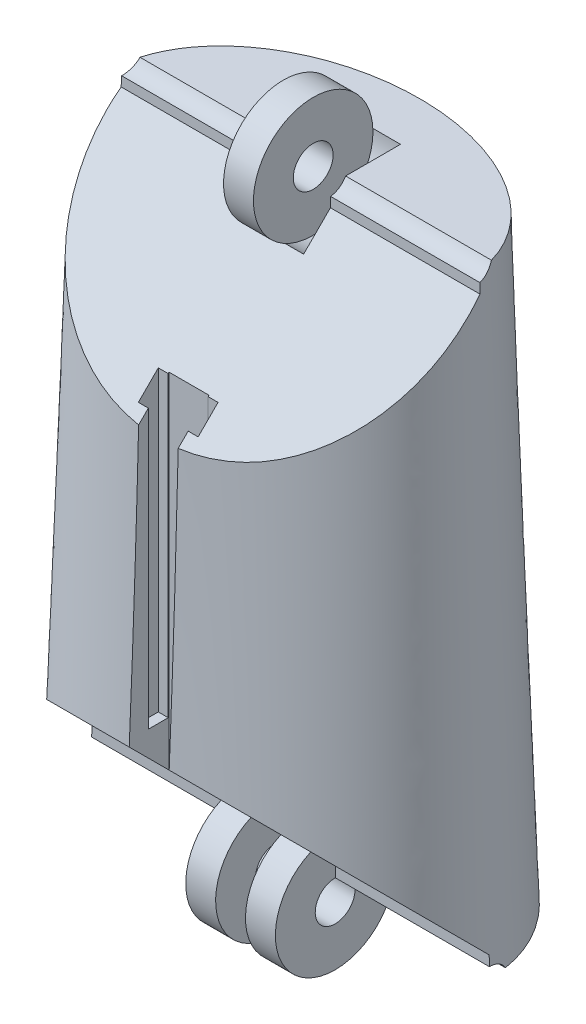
ISO-10303-21;
HEADER;
FILE_DESCRIPTION(('STEP AP214'),'2;1');
FILE_NAME('part.step','',(''),(''),'','','');
FILE_SCHEMA(('AUTOMOTIVE_DESIGN { 1 0 10303 214 1 1 1 1 }'));
ENDSEC;
DATA;
#1=APPLICATION_CONTEXT('core data for automotive mechanical design processes');
#2=APPLICATION_PROTOCOL_DEFINITION('international standard','automotive_design',2000,#1);
#3=PRODUCT_CONTEXT('',#1,'mechanical');
#4=PRODUCT('Part','Part','',(#3));
#5=PRODUCT_RELATED_PRODUCT_CATEGORY('part','',(#4));
#6=PRODUCT_DEFINITION_FORMATION('','',#4);
#7=PRODUCT_DEFINITION_CONTEXT('part definition',#1,'design');
#8=PRODUCT_DEFINITION('design','',#6,#7);
#9=PRODUCT_DEFINITION_SHAPE('','',#8);
#10=(LENGTH_UNIT() NAMED_UNIT(*) SI_UNIT(.MILLI.,.METRE.));
#11=(NAMED_UNIT(*) PLANE_ANGLE_UNIT() SI_UNIT($,.RADIAN.));
#12=(NAMED_UNIT(*) SI_UNIT($,.STERADIAN.) SOLID_ANGLE_UNIT());
#13=UNCERTAINTY_MEASURE_WITH_UNIT(LENGTH_MEASURE(1.E-05),#10,'distance_accuracy_value','');
#14=(GEOMETRIC_REPRESENTATION_CONTEXT(3) GLOBAL_UNCERTAINTY_ASSIGNED_CONTEXT((#13)) GLOBAL_UNIT_ASSIGNED_CONTEXT((#10,
#11,#12)) REPRESENTATION_CONTEXT('',''));
#15=CARTESIAN_POINT('',(0.,0.,0.));
#16=DIRECTION('',(0.,0.,1.));
#17=DIRECTION('',(1.,0.,0.));
#18=AXIS2_PLACEMENT_3D('',#15,#16,#17);
#19=CARTESIAN_POINT('',(0.75,30.4823646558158,-0.398732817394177));
#20=DIRECTION('',(-1.,0.,0.));
#21=DIRECTION('',(0.,0.,1.));
#22=AXIS2_PLACEMENT_3D('',#19,#20,#21);
#23=CYLINDRICAL_SURFACE('',#22,3.);
#24=CARTESIAN_POINT('',(0.75,30.4823646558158,-0.398732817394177));
#25=DIRECTION('',(1.,0.,0.));
#26=DIRECTION('',(0.,0.,-1.));
#27=AXIS2_PLACEMENT_3D('',#24,#25,#26);
#28=CIRCLE('',#27,3.);
#29=CARTESIAN_POINT('',(0.75,30.4823646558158,-3.39873281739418));
#30=VERTEX_POINT('',#29);
#31=EDGE_CURVE('E12',#30,#30,#28,.T.);
#32=ORIENTED_EDGE('',*,*,#31,.F.);
#33=EDGE_LOOP('',(#32));
#34=FACE_BOUND('',#33,.T.);
#35=CARTESIAN_POINT('',(-0.75,30.4823646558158,-0.398732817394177));
#36=DIRECTION('',(1.,0.,0.));
#37=DIRECTION('',(0.,0.,-1.));
#38=AXIS2_PLACEMENT_3D('',#35,#36,#37);
#39=CIRCLE('',#38,3.);
#40=CARTESIAN_POINT('',(-0.75,30.4823646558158,-3.39873281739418));
#41=VERTEX_POINT('',#40);
#42=EDGE_CURVE('E74',#41,#41,#39,.T.);
#43=ORIENTED_EDGE('',*,*,#42,.T.);
#44=EDGE_LOOP('',(#43));
#45=FACE_BOUND('',#44,.T.);
#46=ADVANCED_FACE('F67',(#34,#45),#23,.T.);
#47=CARTESIAN_POINT('',(0.75,30.4823646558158,-0.398732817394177));
#48=DIRECTION('',(1.,0.,0.));
#49=DIRECTION('',(0.,0.,-1.));
#50=AXIS2_PLACEMENT_3D('',#47,#48,#49);
#51=PLANE('',#50);
#52=CARTESIAN_POINT('',(0.750000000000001,30.4823646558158,-0.398732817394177));
#53=DIRECTION('',(1.,0.,0.));
#54=DIRECTION('',(0.,0.,-1.));
#55=AXIS2_PLACEMENT_3D('',#52,#53,#54);
#56=CIRCLE('',#55,1.);
#57=CARTESIAN_POINT('',(0.750000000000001,30.4823646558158,-1.39873281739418));
#58=VERTEX_POINT('',#57);
#59=EDGE_CURVE('E79',#58,#58,#56,.T.);
#60=ORIENTED_EDGE('',*,*,#59,.F.);
#61=EDGE_LOOP('',(#60));
#62=FACE_BOUND('',#61,.T.);
#63=ORIENTED_EDGE('',*,*,#31,.T.);
#64=EDGE_LOOP('',(#63));
#65=FACE_BOUND('',#64,.T.);
#66=ADVANCED_FACE('F96',(#62,#65),#51,.T.);
#67=CARTESIAN_POINT('',(-0.75,30.4823646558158,-0.398732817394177));
#68=DIRECTION('',(1.,0.,0.));
#69=DIRECTION('',(0.,0.,-1.));
#70=AXIS2_PLACEMENT_3D('',#67,#68,#69);
#71=PLANE('',#70);
#72=CARTESIAN_POINT('',(-0.750000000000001,30.4823646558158,-0.398732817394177));
#73=DIRECTION('',(1.,0.,0.));
#74=DIRECTION('',(0.,0.,-1.));
#75=AXIS2_PLACEMENT_3D('',#72,#73,#74);
#76=CIRCLE('',#75,1.);
#77=CARTESIAN_POINT('',(-0.750000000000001,30.4823646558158,-1.39873281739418));
#78=VERTEX_POINT('',#77);
#79=EDGE_CURVE('E70',#78,#78,#76,.T.);
#80=ORIENTED_EDGE('',*,*,#79,.T.);
#81=EDGE_LOOP('',(#80));
#82=FACE_BOUND('',#81,.T.);
#83=ORIENTED_EDGE('',*,*,#42,.F.);
#84=EDGE_LOOP('',(#83));
#85=FACE_BOUND('',#84,.T.);
#86=ADVANCED_FACE('F87',(#82,#85),#71,.F.);
#87=CARTESIAN_POINT('',(-10.0111247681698,30.4823646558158,-0.398732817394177));
#88=DIRECTION('',(1.,0.,0.));
#89=DIRECTION('',(0.,0.,-1.));
#90=AXIS2_PLACEMENT_3D('',#87,#88,#89);
#91=CYLINDRICAL_SURFACE('',#90,1.);
#92=ORIENTED_EDGE('',*,*,#59,.T.);
#93=EDGE_LOOP('',(#92));
#94=FACE_BOUND('',#93,.T.);
#95=ORIENTED_EDGE('',*,*,#79,.F.);
#96=EDGE_LOOP('',(#95));
#97=FACE_BOUND('',#96,.T.);
#98=ADVANCED_FACE('F90',(#94,#97),#91,.F.);
#99=CLOSED_SHELL('',(#46,#66,#86,#98));
#100=MANIFOLD_SOLID_BREP('B2',#99);
#101=CARTESIAN_POINT('',(0.,0.,0.));
#102=DIRECTION('',(0.,1.,0.));
#103=DIRECTION('',(0.,0.,1.));
#104=AXIS2_PLACEMENT_3D('',#101,#102,#103);
#105=PLANE('',#104);
#106=CARTESIAN_POINT('',(0.,0.,0.));
#107=DIRECTION('',(0.,1.,0.));
#108=DIRECTION('',(-1.,0.,0.));
#109=AXIS2_PLACEMENT_3D('',#106,#107,#108);
#110=ELLIPSE('',#109,10.,7.5);
#111=CARTESIAN_POINT('',(9.93308967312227,0.,-0.866064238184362));
#112=VERTEX_POINT('',#111);
#113=CARTESIAN_POINT('',(-9.93316977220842,0.,-0.866067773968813));
#114=VERTEX_POINT('',#113);
#115=EDGE_CURVE('E560',#112,#114,#110,.T.);
#116=ORIENTED_EDGE('',*,*,#115,.F.);
#117=DIRECTION('',(1.,0.,0.));
#118=VECTOR('',#117,1.);
#119=CARTESIAN_POINT('',(-10.0111247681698,0.,-0.866064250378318));
#120=LINE('',#119,#118);
#121=CARTESIAN_POINT('',(2.25,0.,-0.866064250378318));
#122=VERTEX_POINT('',#121);
#123=EDGE_CURVE('E430',#112,#122,#120,.F.);
#124=ORIENTED_EDGE('',*,*,#123,.T.);
#125=DIRECTION('',(0.,0.,-1.));
#126=VECTOR('',#125,1.);
#127=CARTESIAN_POINT('',(2.25,0.,0.));
#128=LINE('',#127,#126);
#129=CARTESIAN_POINT('',(2.25,-2.85844455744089E-08,-2.95805414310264));
#130=VERTEX_POINT('',#129);
#131=EDGE_CURVE('E472',#122,#130,#128,.T.);
#132=ORIENTED_EDGE('',*,*,#131,.T.);
#133=DIRECTION('',(1.,0.,0.));
#134=VECTOR('',#133,1.);
#135=CARTESIAN_POINT('',(-2.25,0.,-2.95805431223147));
#136=LINE('',#135,#134);
#137=CARTESIAN_POINT('',(0.75,-2.85844454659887E-08,-2.95805414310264));
#138=VERTEX_POINT('',#137);
#139=EDGE_CURVE('E482',#130,#138,#136,.F.);
#140=ORIENTED_EDGE('',*,*,#139,.T.);
#141=CARTESIAN_POINT('',(-0.75,0.,-2.95805431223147));
#142=VERTEX_POINT('',#141);
#143=EDGE_CURVE('E481',#138,#142,#136,.F.);
#144=ORIENTED_EDGE('',*,*,#143,.T.);
#145=DIRECTION('',(-1.,0.,0.));
#146=VECTOR('',#145,1.);
#147=CARTESIAN_POINT('',(-0.75,0.,-2.95805413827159));
#148=LINE('',#147,#146);
#149=CARTESIAN_POINT('',(-2.25,0.,-2.95805413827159));
#150=VERTEX_POINT('',#149);
#151=EDGE_CURVE('E456',#150,#142,#148,.F.);
#152=ORIENTED_EDGE('',*,*,#151,.F.);
#153=DIRECTION('',(0.,0.,-1.));
#154=VECTOR('',#153,1.);
#155=CARTESIAN_POINT('',(-2.25,0.,0.));
#156=LINE('',#155,#154);
#157=CARTESIAN_POINT('',(-2.25,0.,-0.866064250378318));
#158=VERTEX_POINT('',#157);
#159=EDGE_CURVE('E478',#158,#150,#156,.T.);
#160=ORIENTED_EDGE('',*,*,#159,.F.);
#161=EDGE_CURVE('E420',#158,#114,#120,.F.);
#162=ORIENTED_EDGE('',*,*,#161,.T.);
#163=EDGE_LOOP('',(#116,#124,#132,#140,#144,#152,#160,#162));
#164=FACE_BOUND('',#163,.T.);
#165=ADVANCED_FACE('F129',(#164),#105,.F.);
#166=CARTESIAN_POINT('',(10.,0.,0.));
#167=DIRECTION('',(0.,0.0176757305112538,0.999843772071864));
#168=DIRECTION('',(0.,-0.999843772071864,0.0176757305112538));
#169=AXIS2_PLACEMENT_3D('',#166,#167,#168);
#170=PLANE('',#169);
#171=DIRECTION('',(1.,0.,0.));
#172=VECTOR('',#171,1.);
#173=CARTESIAN_POINT('',(-10.0111247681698,0.500021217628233,-0.00883962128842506));
#174=LINE('',#173,#172);
#175=CARTESIAN_POINT('',(-2.25,0.500021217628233,-0.00883962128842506));
#176=VERTEX_POINT('',#175);
#177=CARTESIAN_POINT('',(-9.98323882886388,0.500021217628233,-0.00883962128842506));
#178=VERTEX_POINT('',#177);
#179=EDGE_CURVE('E417',#176,#178,#174,.F.);
#180=ORIENTED_EDGE('',*,*,#179,.F.);
#181=DIRECTION('',(0.,0.999843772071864,-0.0176757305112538));
#182=VECTOR('',#181,1.);
#183=CARTESIAN_POINT('',(-2.25,0.,0.));
#184=LINE('',#183,#182);
#185=CARTESIAN_POINT('',(-2.25,0.999843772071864,-0.0176757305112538));
#186=VERTEX_POINT('',#185);
#187=EDGE_CURVE('E475',#176,#186,#184,.T.);
#188=ORIENTED_EDGE('',*,*,#187,.T.);
#189=DIRECTION('',(-1.,0.,0.));
#190=VECTOR('',#189,1.);
#191=CARTESIAN_POINT('',(10.,0.999843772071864,-0.0176757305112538));
#192=LINE('',#191,#190);
#193=CARTESIAN_POINT('',(-9.96646699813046,0.999843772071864,-0.0176757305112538));
#194=VERTEX_POINT('',#193);
#195=EDGE_CURVE('E555',#186,#194,#192,.T.);
#196=ORIENTED_EDGE('',*,*,#195,.T.);
#197=CARTESIAN_POINT('',(-10.,0.000181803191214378,-3.21400633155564E-06));
#198=CARTESIAN_POINT('',(-9.98882233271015,0.333402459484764,-0.00589405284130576));
#199=CARTESIAN_POINT('',(-9.9776446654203,0.666623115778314,-0.01178489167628));
#200=CARTESIAN_POINT('',(-9.96646699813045,0.999843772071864,-0.0176757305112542));
#201=B_SPLINE_CURVE_WITH_KNOTS('',3,(#197,#198,#199,#200),.UNSPECIFIED.,.F.,.F.,(4,4),(0.,
1.0003803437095),.UNSPECIFIED.);
#202=EDGE_CURVE('E588',#178,#194,#201,.T.);
#203=ORIENTED_EDGE('',*,*,#202,.F.);
#204=EDGE_LOOP('',(#180,#188,#196,#203));
#205=FACE_BOUND('',#204,.T.);
#206=ADVANCED_FACE('F604',(#205),#170,.T.);
#207=CARTESIAN_POINT('',(10.,0.999843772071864,-0.0176757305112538));
#208=DIRECTION('',(0.,-0.707106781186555,0.707106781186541));
#209=DIRECTION('',(0.,-0.707106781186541,-0.707106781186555));
#210=AXIS2_PLACEMENT_3D('',#207,#208,#209);
#211=PLANE('',#210);
#212=DIRECTION('',(0.,-0.707106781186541,-0.707106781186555));
#213=VECTOR('',#212,1.);
#214=CARTESIAN_POINT('',(-0.999999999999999,0.999843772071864,-0.0176757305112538));
#215=LINE('',#214,#213);
#216=CARTESIAN_POINT('',(-0.999999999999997,8.10364442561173,7.08612492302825));
#217=VERTEX_POINT('',#216);
#218=CARTESIAN_POINT('',(-1.,6.10319814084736,5.08567863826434));
#219=VERTEX_POINT('',#218);
#220=EDGE_CURVE('E406',#217,#219,#215,.T.);
#221=ORIENTED_EDGE('',*,*,#220,.F.);
#222=CARTESIAN_POINT('',(-9.96646699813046,0.999843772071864,-0.017675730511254));
#223=CARTESIAN_POINT('',(-9.96314583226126,1.1095863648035,0.0920668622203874));
#224=CARTESIAN_POINT('',(-9.95656595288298,1.21926696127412,0.201747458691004));
#225=CARTESIAN_POINT('',(-9.93691455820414,1.43833505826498,0.420815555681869));
#226=CARTESIAN_POINT('',(-9.92384316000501,1.54772256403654,0.530203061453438));
#227=CARTESIAN_POINT('',(-9.87493065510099,1.87519345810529,0.857673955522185));
#228=CARTESIAN_POINT('',(-9.82939110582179,2.09258954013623,1.07507003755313));
#229=CARTESIAN_POINT('',(-9.71232482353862,2.52439395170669,1.5068744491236));
#230=CARTESIAN_POINT('',(-9.64073759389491,2.73879410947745,1.72127460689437));
#231=CARTESIAN_POINT('',(-9.51391112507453,3.0564606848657,2.03894118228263));
#232=CARTESIAN_POINT('',(-9.46838957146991,3.16170351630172,2.14418401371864));
#233=CARTESIAN_POINT('',(-9.37083352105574,3.37066868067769,2.35314917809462));
#234=CARTESIAN_POINT('',(-9.31879902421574,3.47439101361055,2.45687151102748));
#235=CARTESIAN_POINT('',(-9.15417561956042,3.78110339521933,2.76358389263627));
#236=CARTESIAN_POINT('',(-9.03226815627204,3.98163327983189,2.96411377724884));
#237=CARTESIAN_POINT('',(-8.76402277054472,4.37436471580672,3.35684521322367));
#238=CARTESIAN_POINT('',(-8.61768554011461,4.56656650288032,3.54904700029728));
#239=CARTESIAN_POINT('',(-8.38023992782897,4.84705842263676,3.82953892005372));
#240=CARTESIAN_POINT('',(-8.29815021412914,4.93920664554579,3.92168714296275));
#241=CARTESIAN_POINT('',(-8.12804726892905,5.12072246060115,4.10320295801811));
#242=CARTESIAN_POINT('',(-8.04003399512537,5.21009003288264,4.19257053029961));
#243=CARTESIAN_POINT('',(-7.76742223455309,5.47377343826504,4.45625393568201));
#244=CARTESIAN_POINT('',(-7.57420900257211,5.64372050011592,4.62620099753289));
#245=CARTESIAN_POINT('',(-7.27475792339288,5.88361279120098,4.86609328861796));
#246=CARTESIAN_POINT('',(-7.17674380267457,5.95878883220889,4.94126932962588));
#247=CARTESIAN_POINT('',(-6.97616597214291,6.1060540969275,5.08853459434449));
#248=CARTESIAN_POINT('',(-6.87360239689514,6.17814341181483,5.16062390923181));
#249=CARTESIAN_POINT('',(-6.66407573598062,6.3190383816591,5.30151887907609));
#250=CARTESIAN_POINT('',(-6.55711304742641,6.38784433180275,5.37032482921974));
#251=CARTESIAN_POINT('',(-6.33890642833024,6.52196704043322,5.50444753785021));
#252=CARTESIAN_POINT('',(-6.22766239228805,6.58728371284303,5.56976421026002));
#253=CARTESIAN_POINT('',(-5.88789036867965,6.77787030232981,5.76035079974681));
#254=CARTESIAN_POINT('',(-5.65329107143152,6.89779788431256,5.88027838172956));
#255=CARTESIAN_POINT('',(-5.16987312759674,7.12230931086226,6.10478980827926));
#256=CARTESIAN_POINT('',(-4.9210540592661,7.22689270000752,6.20937319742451));
#257=CARTESIAN_POINT('',(-4.42448556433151,7.41482572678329,6.39730622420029));
#258=CARTESIAN_POINT('',(-4.17735922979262,7.49899918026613,6.48147967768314));
#259=CARTESIAN_POINT('',(-3.67389371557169,7.6522047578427,6.63468525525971));
#260=CARTESIAN_POINT('',(-3.41755491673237,7.72123750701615,6.70371800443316));
#261=CARTESIAN_POINT('',(-2.89760041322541,7.84350507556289,6.82598557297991));
#262=CARTESIAN_POINT('',(-2.63398821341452,7.89674736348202,6.87922786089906));
#263=CARTESIAN_POINT('',(-2.10134551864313,7.98742646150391,6.9699069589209));
#264=CARTESIAN_POINT('',(-1.83231485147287,8.02486276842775,7.00734326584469));
#265=CARTESIAN_POINT('',(-1.42710524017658,8.06888540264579,7.05136590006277));
#266=CARTESIAN_POINT('',(-1.29218734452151,8.08151664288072,7.06399714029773));
#267=CARTESIAN_POINT('',(-1.02172134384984,8.10282681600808,7.08530731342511));
#268=CARTESIAN_POINT('',(-0.886173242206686,8.11150577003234,7.09398626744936));
#269=CARTESIAN_POINT('',(-0.614694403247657,8.12496163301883,7.10744213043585));
#270=CARTESIAN_POINT('',(-0.478763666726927,8.12973855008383,7.11221904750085));
#271=CARTESIAN_POINT('',(-0.206740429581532,8.13543503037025,7.11791552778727));
#272=CARTESIAN_POINT('',(-0.0706479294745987,8.13635460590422,7.11883510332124));
#273=CARTESIAN_POINT('',(0.201621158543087,8.13429727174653,7.11677776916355));
#274=CARTESIAN_POINT('',(0.337797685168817,8.13131627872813,7.11379677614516));
#275=CARTESIAN_POINT('',(0.609868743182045,8.12146001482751,7.10394051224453));
#276=CARTESIAN_POINT('',(0.745763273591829,8.11458473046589,7.0970652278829));
#277=CARTESIAN_POINT('',(1.01704665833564,8.09697247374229,7.07945297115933));
#278=CARTESIAN_POINT('',(1.15243552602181,8.08623560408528,7.06871610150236));
#279=CARTESIAN_POINT('',(1.42249950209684,8.06095617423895,7.04343667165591));
#280=CARTESIAN_POINT('',(1.55717461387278,8.04641363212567,7.02889412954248));
#281=CARTESIAN_POINT('',(1.83099972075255,8.01286873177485,6.99534922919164));
#282=CARTESIAN_POINT('',(1.97011157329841,7.99371038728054,6.9761908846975));
#283=CARTESIAN_POINT('',(2.24708972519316,7.95131798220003,6.93379847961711));
#284=CARTESIAN_POINT('',(2.38495599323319,7.92808381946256,6.9105643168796));
#285=CARTESIAN_POINT('',(2.65926262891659,7.87768451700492,6.86016501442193));
#286=CARTESIAN_POINT('',(2.79570278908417,7.85051881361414,6.83299931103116));
#287=CARTESIAN_POINT('',(3.06693946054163,7.79235548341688,6.7748359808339));
#288=CARTESIAN_POINT('',(3.20173598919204,7.76135789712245,6.74383839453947));
#289=CARTESIAN_POINT('',(3.46926996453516,7.69546577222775,6.67794626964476));
#290=CARTESIAN_POINT('',(3.60200924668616,7.66057496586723,6.64305546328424));
#291=CARTESIAN_POINT('',(3.86527706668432,7.58684485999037,6.56932535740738));
#292=CARTESIAN_POINT('',(3.99580561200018,7.54800557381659,6.5304860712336));
#293=CARTESIAN_POINT('',(4.25436966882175,7.46641330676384,6.44889380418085));
#294=CARTESIAN_POINT('',(4.38240555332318,7.42366091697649,6.4061414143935));
#295=CARTESIAN_POINT('',(4.63577935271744,7.33433539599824,6.31681589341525));
#296=CARTESIAN_POINT('',(4.76111731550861,7.28776233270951,6.27024283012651));
#297=CARTESIAN_POINT('',(4.96922280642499,7.20653125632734,6.18901175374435));
#298=CARTESIAN_POINT('',(5.05274950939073,7.17284316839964,6.15532366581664));
#299=CARTESIAN_POINT('',(5.21813928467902,7.10349053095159,6.0859710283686));
#300=CARTESIAN_POINT('',(5.30000252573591,7.06782618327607,6.05030668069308));
#301=CARTESIAN_POINT('',(5.46203580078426,6.99462815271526,5.97710865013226));
#302=CARTESIAN_POINT('',(5.54220587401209,6.95709451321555,5.93957501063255));
#303=CARTESIAN_POINT('',(5.70078766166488,6.88021141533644,5.86269191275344));
#304=CARTESIAN_POINT('',(5.77919927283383,6.84086185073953,5.82334234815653));
#305=CARTESIAN_POINT('',(6.01174827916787,6.72023553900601,5.70271603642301));
#306=CARTESIAN_POINT('',(6.16322346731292,6.63637046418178,5.61885096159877));
#307=CARTESIAN_POINT('',(6.45855771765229,6.46221417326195,5.44469467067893));
#308=CARTESIAN_POINT('',(6.6024171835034,6.37192329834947,5.35440379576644));
#309=CARTESIAN_POINT('',(6.8821425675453,6.18532936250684,5.16780985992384));
#310=CARTESIAN_POINT('',(7.01800763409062,6.08902566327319,5.07150616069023));
#311=CARTESIAN_POINT('',(7.28148416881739,5.89094726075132,4.87342775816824));
#312=CARTESIAN_POINT('',(7.40909590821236,5.78917273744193,4.77165323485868));
#313=CARTESIAN_POINT('',(7.70020279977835,5.54281677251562,4.5252972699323));
#314=CARTESIAN_POINT('',(7.86001523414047,5.39604873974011,4.37852923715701));
#315=CARTESIAN_POINT('',(8.16325124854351,5.09434317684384,4.07682367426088));
#316=CARTESIAN_POINT('',(8.30667734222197,4.93940690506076,3.92188740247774));
#317=CARTESIAN_POINT('',(8.57644533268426,4.62212323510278,3.60460373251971));
#318=CARTESIAN_POINT('',(8.70277734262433,4.45977162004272,3.44225211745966));
#319=CARTESIAN_POINT('',(8.87910994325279,4.21161022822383,3.19409072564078));
#320=CARTESIAN_POINT('',(8.93569912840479,4.12810733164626,3.1105878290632));
#321=CARTESIAN_POINT('',(9.04449212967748,3.95968461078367,2.94216510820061));
#322=CARTESIAN_POINT('',(9.09669589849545,3.87476477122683,2.85724526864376));
#323=CARTESIAN_POINT('',(9.25718775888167,3.59991487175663,2.58239536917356));
#324=CARTESIAN_POINT('',(9.35679821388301,3.40740829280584,2.38988879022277));
#325=CARTESIAN_POINT('',(9.53375822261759,3.01733993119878,1.9998204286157));
#326=CARTESIAN_POINT('',(9.61110358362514,2.81977720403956,1.80225770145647));
#327=CARTESIAN_POINT('',(9.74332064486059,2.42124914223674,1.40372963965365));
#328=CARTESIAN_POINT('',(9.798226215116,2.22028941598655,1.20276991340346));
#329=CARTESIAN_POINT('',(9.88552683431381,1.81602282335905,0.798503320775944));
#330=CARTESIAN_POINT('',(9.91793380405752,1.61271725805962,0.595197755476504));
#331=CARTESIAN_POINT('',(9.94616559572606,1.34077108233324,0.323251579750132));
#332=CARTESIAN_POINT('',(9.95198098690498,1.2725969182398,0.2550774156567));
#333=CARTESIAN_POINT('',(9.9611035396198,1.13623806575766,0.118718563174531));
#334=CARTESIAN_POINT('',(9.964413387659,1.06805346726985,0.0505339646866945));
#335=CARTESIAN_POINT('',(9.96647852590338,0.999843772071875,-0.0176757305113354));
#336=B_SPLINE_CURVE_WITH_KNOTS('',3,(#222,#223,#224,#225,#226,#227,#228,#229,#230,#231,#232,
#233,#234,#235,#236,#237,#238,#239,#240,#241,#242,#243,#244,#245,#246,#247,#248,#249,#250,#251,
#252,#253,#254,#255,#256,#257,#258,#259,#260,#261,#262,#263,#264,#265,#266,#267,#268,#269,#270,
#271,#272,#273,#274,#275,#276,#277,#278,#279,#280,#281,#282,#283,#284,#285,#286,#287,#288,#289,
#290,#291,#292,#293,#294,#295,#296,#297,#298,#299,#300,#301,#302,#303,#304,#305,#306,#307,#308,
#309,#310,#311,#312,#313,#314,#315,#316,#317,#318,#319,#320,#321,#322,#323,#324,#325,#326,#327,
#328,#329,#330,#331,#332,#333,#334,#335),.UNSPECIFIED.,.F.,.F.,(4,2,2,2,2,2,2,2,2,2,2,2,2,2,2,2,
2,2,2,2,2,2,2,2,2,2,2,2,2,2,2,2,2,2,2,2,2,2,2,2,2,2,2,2,2,2,2,2,2,2,2,2,2,2,2,2,4),(0.,
0.465635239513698,0.931262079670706,1.86249749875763,2.79590969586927,3.26270243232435,
3.72949517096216,4.65431664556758,5.57911192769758,6.04101480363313,6.50292097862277,
7.42648428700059,7.86019023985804,8.29388337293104,8.72753744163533,9.16120220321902,
10.0284022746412,10.8956280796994,11.7175521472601,12.539442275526,13.3609430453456,
14.1824699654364,14.590659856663,14.9988475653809,15.4070344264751,15.8152199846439,
16.2238331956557,16.6324478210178,17.041051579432,17.4496533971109,17.8747062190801,
18.2997696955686,18.7248941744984,19.1500141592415,19.5747300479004,19.9994445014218,
20.4240949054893,20.8487377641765,21.1371713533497,21.4255755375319,21.7139730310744,
22.0023874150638,22.5791321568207,23.1558462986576,23.732621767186,24.3093782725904,
25.094406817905,25.879314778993,26.6646747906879,27.0574472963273,27.4502240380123,
28.3188645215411,29.1876684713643,30.0551561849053,30.9221839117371,31.2119246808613,
31.501354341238),.UNSPECIFIED.);
#337=EDGE_CURVE('E614',#194,#217,#336,.T.);
#338=ORIENTED_EDGE('',*,*,#337,.F.);
#339=ORIENTED_EDGE('',*,*,#195,.F.);
#340=DIRECTION('',(0.,0.707106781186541,0.707106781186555));
#341=VECTOR('',#340,1.);
#342=CARTESIAN_POINT('',(-2.25,0.999843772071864,-0.0176757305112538));
#343=LINE('',#342,#341);
#344=CARTESIAN_POINT('',(-2.25,2.23978064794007,1.22226110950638));
#345=VERTEX_POINT('',#344);
#346=EDGE_CURVE('E711',#186,#345,#343,.T.);
#347=ORIENTED_EDGE('',*,*,#346,.T.);
#348=DIRECTION('',(-1.,0.,0.));
#349=VECTOR('',#348,1.);
#350=CARTESIAN_POINT('',(-0.75,2.23978063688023,1.22226113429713));
#351=LINE('',#350,#349);
#352=CARTESIAN_POINT('',(-0.75,2.23978064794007,1.22226110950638));
#353=VERTEX_POINT('',#352);
#354=EDGE_CURVE('E448',#345,#353,#351,.F.);
#355=ORIENTED_EDGE('',*,*,#354,.T.);
#356=DIRECTION('',(1.,0.,0.));
#357=VECTOR('',#356,1.);
#358=CARTESIAN_POINT('',(-2.25,2.23978058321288,1.22226108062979));
#359=LINE('',#358,#357);
#360=CARTESIAN_POINT('',(0.75,2.23978058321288,1.22226108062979));
#361=VERTEX_POINT('',#360);
#362=EDGE_CURVE('E707',#361,#353,#359,.F.);
#363=ORIENTED_EDGE('',*,*,#362,.F.);
#364=CARTESIAN_POINT('',(2.25,2.23978063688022,1.22226113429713));
#365=VERTEX_POINT('',#364);
#366=EDGE_CURVE('E708',#365,#361,#359,.F.);
#367=ORIENTED_EDGE('',*,*,#366,.F.);
#368=DIRECTION('',(0.,0.707106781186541,0.707106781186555));
#369=VECTOR('',#368,1.);
#370=CARTESIAN_POINT('',(2.25,0.999843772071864,-0.0176757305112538));
#371=LINE('',#370,#369);
#372=CARTESIAN_POINT('',(2.25,0.999843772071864,-0.0176757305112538));
#373=VERTEX_POINT('',#372);
#374=EDGE_CURVE('E704',#373,#365,#371,.T.);
#375=ORIENTED_EDGE('',*,*,#374,.F.);
#376=CARTESIAN_POINT('',(9.96647852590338,0.999843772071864,-0.0176757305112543));
#377=VERTEX_POINT('',#376);
#378=EDGE_CURVE('E562',#377,#373,#192,.T.);
#379=ORIENTED_EDGE('',*,*,#378,.F.);
#380=CARTESIAN_POINT('',(0.99999999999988,8.09758297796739,7.08006347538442));
#381=VERTEX_POINT('',#380);
#382=EDGE_CURVE('E624',#381,#377,#336,.T.);
#383=ORIENTED_EDGE('',*,*,#382,.F.);
#384=DIRECTION('',(0.,-0.707106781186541,-0.707106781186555));
#385=VECTOR('',#384,1.);
#386=CARTESIAN_POINT('',(0.999999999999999,0.999843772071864,-0.0176757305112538));
#387=LINE('',#386,#385);
#388=CARTESIAN_POINT('',(1.,6.10319814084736,5.08567863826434));
#389=VERTEX_POINT('',#388);
#390=EDGE_CURVE('E397',#381,#389,#387,.T.);
#391=ORIENTED_EDGE('',*,*,#390,.T.);
#392=DIRECTION('',(1.,0.,0.));
#393=VECTOR('',#392,1.);
#394=CARTESIAN_POINT('',(10.,6.10319814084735,5.08567863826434));
#395=LINE('',#394,#393);
#396=EDGE_CURVE('E409',#219,#389,#395,.T.);
#397=ORIENTED_EDGE('',*,*,#396,.F.);
#398=EDGE_LOOP('',(#221,#338,#339,#347,#355,#363,#367,#375,#379,#383,#391,#397));
#399=FACE_BOUND('',#398,.T.);
#400=ADVANCED_FACE('F605',(#399),#211,.T.);
#401=CARTESIAN_POINT('',(-8.99998038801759,30.,-0.0134688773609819));
#402=DIRECTION('',(0.,-1.,0.));
#403=DIRECTION('',(0.,0.,-1.));
#404=AXIS2_PLACEMENT_3D('',#401,#402,#403);
#405=PLANE('',#404);
#406=CARTESIAN_POINT('',(9.,30.,0.));
#407=CARTESIAN_POINT('',(9.,30.,-0.516946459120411));
#408=CARTESIAN_POINT('',(8.91454474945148,30.,-1.01862636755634));
#409=CARTESIAN_POINT('',(8.67000825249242,30.,-1.75035969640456));
#410=CARTESIAN_POINT('',(8.56953009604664,30.,-1.98811904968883));
#411=CARTESIAN_POINT('',(8.3383775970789,30.,-2.44349860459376));
#412=CARTESIAN_POINT('',(8.20719000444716,30.,-2.6626483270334));
#413=CARTESIAN_POINT('',(7.91620380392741,30.,-3.08529635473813));
#414=CARTESIAN_POINT('',(7.75633498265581,30.,-3.2884548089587));
#415=CARTESIAN_POINT('',(7.4186247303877,30.,-3.67084655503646));
#416=CARTESIAN_POINT('',(7.23983784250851,30.,-3.85151258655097));
#417=CARTESIAN_POINT('',(6.86455163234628,30.,-4.19406559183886));
#418=CARTESIAN_POINT('',(6.66804109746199,30.,-4.35594067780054));
#419=CARTESIAN_POINT('',(6.2585920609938,30.,-4.66227360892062));
#420=CARTESIAN_POINT('',(6.04501636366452,30.,-4.80699867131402));
#421=CARTESIAN_POINT('',(5.39328718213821,30.,-5.20908796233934));
#422=CARTESIAN_POINT('',(4.94068950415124,30.,-5.43768710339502));
#423=CARTESIAN_POINT('',(4.00469659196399,30.,-5.82778549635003));
#424=CARTESIAN_POINT('',(3.51890957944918,30.,-5.98971973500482));
#425=CARTESIAN_POINT('',(2.03359549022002,30.,-6.37590234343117));
#426=CARTESIAN_POINT('',(1.02551309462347,30.,-6.49993137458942));
#427=CARTESIAN_POINT('',(-1.02386178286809,30.,-6.50006857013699));
#428=CARTESIAN_POINT('',(-2.02945140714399,30.,-6.37579027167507));
#429=CARTESIAN_POINT('',(-3.25682218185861,30.,-6.05815063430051));
#430=CARTESIAN_POINT('',(-3.5008531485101,30.,-5.9862904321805));
#431=CARTESIAN_POINT('',(-3.98582472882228,30.,-5.82472781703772));
#432=CARTESIAN_POINT('',(-4.22691614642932,30.,-5.73486883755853));
#433=CARTESIAN_POINT('',(-4.93374409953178,30.,-5.44116492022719));
#434=CARTESIAN_POINT('',(-5.38699951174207,30.,-5.2123388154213));
#435=CARTESIAN_POINT('',(-6.03622065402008,30.,-4.81273084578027));
#436=CARTESIAN_POINT('',(-6.24748304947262,30.,-4.67007028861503));
#437=CARTESIAN_POINT('',(-6.65849036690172,30.,-4.36357551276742));
#438=CARTESIAN_POINT('',(-6.85759791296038,30.,-4.20003219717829));
#439=CARTESIAN_POINT('',(-7.42342346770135,30.,-3.68468300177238));
#440=CARTESIAN_POINT('',(-7.76322784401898,30.,-3.30590336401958));
#441=CARTESIAN_POINT('',(-8.2019942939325,30.,-2.67096372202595));
#442=CARTESIAN_POINT('',(-8.33450272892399,30.,-2.45027406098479));
#443=CARTESIAN_POINT('',(-8.56595659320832,30.,-1.99598995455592));
#444=CARTESIAN_POINT('',(-8.66557447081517,30.,-1.76147582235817));
#445=CARTESIAN_POINT('',(-8.82917077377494,30.,-1.27613767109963));
#446=CARTESIAN_POINT('',(-8.8929923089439,30.,-1.02399008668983));
#447=CARTESIAN_POINT('',(-8.97756620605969,30.,-0.520942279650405));
#448=CARTESIAN_POINT('',(-8.99923928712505,30.,-0.267950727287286));
#449=CARTESIAN_POINT('',(-9.00072148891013,30.,0.241012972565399));
#450=CARTESIAN_POINT('',(-8.98006114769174,30.,0.499374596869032));
#451=CARTESIAN_POINT('',(-8.89696537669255,30.,1.00658802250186));
#452=CARTESIAN_POINT('',(-8.83521037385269,30.,1.25432771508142));
#453=CARTESIAN_POINT('',(-8.67435947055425,30.,1.7389653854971));
#454=CARTESIAN_POINT('',(-8.57450145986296,30.,1.97726662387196));
#455=CARTESIAN_POINT('',(-8.34244089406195,30.,2.43651204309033));
#456=CARTESIAN_POINT('',(-8.21122986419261,30.,2.65612971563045));
#457=CARTESIAN_POINT('',(-7.77724994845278,30.,3.28839171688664));
#458=CARTESIAN_POINT('',(-7.43108540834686,30.,3.67655471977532));
#459=CARTESIAN_POINT('',(-6.67953742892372,30.,4.36333055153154));
#460=CARTESIAN_POINT('',(-6.27130588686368,30.,4.66677286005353));
#461=CARTESIAN_POINT('',(-5.61757810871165,30.,5.07100925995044));
#462=CARTESIAN_POINT('',(-5.39283638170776,30.,5.1969475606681));
#463=CARTESIAN_POINT('',(-4.93829033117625,30.,5.42855253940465));
#464=CARTESIAN_POINT('',(-4.70747897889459,30.,5.53486266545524));
#465=CARTESIAN_POINT('',(-4.0052759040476,30.,5.82758544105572));
#466=CARTESIAN_POINT('',(-3.52418972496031,30.,5.98799051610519));
#467=CARTESIAN_POINT('',(-2.538251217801,30.,6.24504259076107));
#468=CARTESIAN_POINT('',(-2.03179977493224,30.,6.34140271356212));
#469=CARTESIAN_POINT('',(-1.02174243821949,30.,6.46824246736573));
#470=CARTESIAN_POINT('',(-0.515007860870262,30.,6.49972591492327));
#471=CARTESIAN_POINT('',(0.501795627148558,30.,6.50027054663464));
#472=CARTESIAN_POINT('',(1.01520325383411,30.,6.46883568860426));
#473=CARTESIAN_POINT('',(2.02775349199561,30.,6.34213641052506));
#474=CARTESIAN_POINT('',(2.52544582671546,30.,6.24756820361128));
#475=CARTESIAN_POINT('',(3.5031858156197,30.,5.99425195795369));
#476=CARTESIAN_POINT('',(3.9832552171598,30.,5.83558302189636));
#477=CARTESIAN_POINT('',(4.92351490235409,30.,5.44593789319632));
#478=CARTESIAN_POINT('',(5.38586137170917,30.,5.21303598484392));
#479=CARTESIAN_POINT('',(6.25367958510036,30.,4.67888411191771));
#480=CARTESIAN_POINT('',(6.66316742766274,30.,4.37667883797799));
#481=CARTESIAN_POINT('',(7.2325027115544,30.,3.85878853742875));
#482=CARTESIAN_POINT('',(7.41449902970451,30.,3.67519752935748));
#483=CARTESIAN_POINT('',(7.75312297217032,30.,3.29240550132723));
#484=CARTESIAN_POINT('',(7.91085463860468,30.,3.09228057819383));
#485=CARTESIAN_POINT('',(8.34569620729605,30.,2.46299606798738));
#486=CARTESIAN_POINT('',(8.5859507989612,30.,1.9988528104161));
#487=CARTESIAN_POINT('',(8.82983431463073,30.,1.27358345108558));
#488=CARTESIAN_POINT('',(8.89273758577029,30.,1.02583003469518));
#489=CARTESIAN_POINT('',(8.97814875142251,30.,0.517151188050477));
#490=CARTESIAN_POINT('',(9.,30.,0.258473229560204));
#491=CARTESIAN_POINT('',(9.,30.,0.));
#492=B_SPLINE_CURVE_WITH_KNOTS('',3,(#406,#407,#408,#409,#410,#411,#412,#413,#414,#415,#416,
#417,#418,#419,#420,#421,#422,#423,#424,#425,#426,#427,#428,#429,#430,#431,#432,#433,#434,#435,
#436,#437,#438,#439,#440,#441,#442,#443,#444,#445,#446,#447,#448,#449,#450,#451,#452,#453,#454,
#455,#456,#457,#458,#459,#460,#461,#462,#463,#464,#465,#466,#467,#468,#469,#470,#471,#472,#473,
#474,#475,#476,#477,#478,#479,#480,#481,#482,#483,#484,#485,#486,#487,#488,#489,#490,#491),
.UNSPECIFIED.,.T.,.F.,(4,2,2,2,2,2,2,2,2,2,2,2,2,2,2,2,2,2,2,2,2,2,2,2,2,2,2,2,2,2,2,2,2,2,2,2,
2,2,2,2,2,2,4),(0.,0.0312500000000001,0.0468750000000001,0.0625000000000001,0.0781250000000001,
0.0937500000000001,0.109375,0.125,0.15625,0.1875,0.25,0.312500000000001,0.328125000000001,
0.343750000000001,0.375000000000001,0.390625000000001,0.406250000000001,0.437500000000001,
0.453125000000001,0.468750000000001,0.484375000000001,0.500000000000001,0.515625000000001,
0.531250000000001,0.546875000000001,0.562500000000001,0.593750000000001,0.625000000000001,
0.640625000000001,0.656250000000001,0.687500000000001,0.718750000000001,0.750000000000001,
0.781250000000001,0.8125,0.84375,0.875,0.90625,0.921875,0.9375,0.96875,0.984375,1.),.UNSPECIFIED.);
#493=CARTESIAN_POINT('',(8.82279405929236,30.,-1.27470004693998));
#494=VERTEX_POINT('',#493);
#495=CARTESIAN_POINT('',(-8.82274460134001,30.,-1.27470342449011));
#496=VERTEX_POINT('',#495);
#497=EDGE_CURVE('E691',#494,#496,#492,.T.);
#498=ORIENTED_EDGE('',*,*,#497,.T.);
#499=DIRECTION('',(1.,0.,0.));
#500=VECTOR('',#499,1.);
#501=CARTESIAN_POINT('',(-10.0111247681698,30.,-1.27470332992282));
#502=LINE('',#501,#500);
#503=CARTESIAN_POINT('',(-1.5,30.,-1.27470332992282));
#504=VERTEX_POINT('',#503);
#505=EDGE_CURVE('E830',#496,#504,#502,.T.);
#506=ORIENTED_EDGE('',*,*,#505,.T.);
#507=DIRECTION('',(0.,0.,1.));
#508=VECTOR('',#507,1.);
#509=CARTESIAN_POINT('',(-1.5,30.,-0.0134688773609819));
#510=LINE('',#509,#508);
#511=CARTESIAN_POINT('',(-1.5,30.,-4.03031417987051));
#512=VERTEX_POINT('',#511);
#513=EDGE_CURVE('E547',#512,#504,#510,.T.);
#514=ORIENTED_EDGE('',*,*,#513,.F.);
#515=DIRECTION('',(1.,0.,0.));
#516=VECTOR('',#515,1.);
#517=CARTESIAN_POINT('',(-1.5,30.,-4.03031417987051));
#518=LINE('',#517,#516);
#519=CARTESIAN_POINT('',(1.5,30.,-4.03031417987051));
#520=VERTEX_POINT('',#519);
#521=EDGE_CURVE('E551',#512,#520,#518,.T.);
#522=ORIENTED_EDGE('',*,*,#521,.T.);
#523=DIRECTION('',(0.,0.,1.));
#524=VECTOR('',#523,1.);
#525=CARTESIAN_POINT('',(1.5,30.,-0.0134688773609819));
#526=LINE('',#525,#524);
#527=CARTESIAN_POINT('',(1.5,30.,-1.27470332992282));
#528=VERTEX_POINT('',#527);
#529=EDGE_CURVE('E539',#520,#528,#526,.T.);
#530=ORIENTED_EDGE('',*,*,#529,.T.);
#531=EDGE_CURVE('E492',#528,#494,#502,.T.);
#532=ORIENTED_EDGE('',*,*,#531,.T.);
#533=EDGE_LOOP('',(#498,#506,#514,#522,#530,#532));
#534=FACE_BOUND('',#533,.T.);
#535=ADVANCED_FACE('F131',(#534),#405,.F.);
#536=CARTESIAN_POINT('',(10.,29.0001562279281,-0.512679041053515));
#537=DIRECTION('',(0.,0.707106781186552,0.707106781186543));
#538=DIRECTION('',(0.,-0.707106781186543,0.707106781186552));
#539=AXIS2_PLACEMENT_3D('',#536,#537,#538);
#540=PLANE('',#539);
#541=DIRECTION('',(-1.,0.,0.));
#542=VECTOR('',#541,1.);
#543=CARTESIAN_POINT('',(10.,23.3599701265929,5.12750706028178));
#544=LINE('',#543,#542);
#545=CARTESIAN_POINT('',(-1.,23.3599701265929,5.12750706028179));
#546=VERTEX_POINT('',#545);
#547=CARTESIAN_POINT('',(-1.5,23.3599701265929,5.12750706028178));
#548=VERTEX_POINT('',#547);
#549=EDGE_CURVE('E380',#546,#548,#544,.T.);
#550=ORIENTED_EDGE('',*,*,#549,.F.);
#551=DIRECTION('',(0.,-0.707106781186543,0.707106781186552));
#552=VECTOR('',#551,1.);
#553=CARTESIAN_POINT('',(-0.999999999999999,29.0001562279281,-0.512679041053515));
#554=LINE('',#553,#552);
#555=CARTESIAN_POINT('',(-1.,23.4017985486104,5.08567863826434));
#556=VERTEX_POINT('',#555);
#557=EDGE_CURVE('E402',#556,#546,#554,.T.);
#558=ORIENTED_EDGE('',*,*,#557,.F.);
#559=DIRECTION('',(-1.,0.,0.));
#560=VECTOR('',#559,1.);
#561=CARTESIAN_POINT('',(10.,23.4017985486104,5.08567863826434));
#562=LINE('',#561,#560);
#563=CARTESIAN_POINT('',(1.,23.4017985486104,5.08567863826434));
#564=VERTEX_POINT('',#563);
#565=EDGE_CURVE('E725',#564,#556,#562,.T.);
#566=ORIENTED_EDGE('',*,*,#565,.F.);
#567=DIRECTION('',(0.,-0.707106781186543,0.707106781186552));
#568=VECTOR('',#567,1.);
#569=CARTESIAN_POINT('',(0.999999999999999,29.0001562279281,-0.512679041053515));
#570=LINE('',#569,#568);
#571=CARTESIAN_POINT('',(1.,23.3599701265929,5.12750706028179));
#572=VERTEX_POINT('',#571);
#573=EDGE_CURVE('E393',#564,#572,#570,.T.);
#574=ORIENTED_EDGE('',*,*,#573,.T.);
#575=CARTESIAN_POINT('',(1.5,23.3599701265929,5.12750706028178));
#576=VERTEX_POINT('',#575);
#577=EDGE_CURVE('E376',#576,#572,#544,.T.);
#578=ORIENTED_EDGE('',*,*,#577,.F.);
#579=DIRECTION('',(0.,0.707106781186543,-0.707106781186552));
#580=VECTOR('',#579,1.);
#581=CARTESIAN_POINT('',(1.5,29.0001562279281,-0.512679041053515));
#582=LINE('',#581,#580);
#583=CARTESIAN_POINT('',(1.5,22.3599701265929,6.12750706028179));
#584=VERTEX_POINT('',#583);
#585=EDGE_CURVE('E139',#584,#576,#582,.T.);
#586=ORIENTED_EDGE('',*,*,#585,.F.);
#587=DIRECTION('',(1.,0.,0.));
#588=VECTOR('',#587,1.);
#589=CARTESIAN_POINT('',(10.,22.3599701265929,6.12750706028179));
#590=LINE('',#589,#588);
#591=CARTESIAN_POINT('',(1.,22.3599701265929,6.12750706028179));
#592=VERTEX_POINT('',#591);
#593=EDGE_CURVE('E367',#592,#584,#590,.T.);
#594=ORIENTED_EDGE('',*,*,#593,.F.);
#595=CARTESIAN_POINT('',(1.,21.8599701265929,6.62750706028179));
#596=VERTEX_POINT('',#595);
#597=EDGE_CURVE('E388',#592,#596,#570,.T.);
#598=ORIENTED_EDGE('',*,*,#597,.T.);
#599=CARTESIAN_POINT('',(9.00496673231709,29.0001562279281,-0.512679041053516));
#600=CARTESIAN_POINT('',(9.03165184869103,28.8142365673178,-0.326759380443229));
#601=CARTESIAN_POINT('',(9.04712064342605,28.627520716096,-0.140043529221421));
#602=CARTESIAN_POINT('',(9.0557293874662,28.2538610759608,0.233616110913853));
#603=CARTESIAN_POINT('',(9.04887299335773,28.0669173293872,0.420559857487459));
#604=CARTESIAN_POINT('',(9.01296893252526,27.6943650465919,0.793112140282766));
#605=CARTESIAN_POINT('',(8.98395228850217,27.5087550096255,0.978722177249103));
#606=CARTESIAN_POINT('',(8.90408386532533,27.1398896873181,1.34758749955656));
#607=CARTESIAN_POINT('',(8.85323151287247,26.956634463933,1.53084272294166));
#608=CARTESIAN_POINT('',(8.72991270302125,26.5936060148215,1.89387117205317));
#609=CARTESIAN_POINT('',(8.6574232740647,26.4138367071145,2.07364047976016));
#610=CARTESIAN_POINT('',(8.49192362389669,26.0590588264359,2.42841836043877));
#611=CARTESIAN_POINT('',(8.39891345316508,25.8840502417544,2.60342694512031));
#612=CARTESIAN_POINT('',(8.24402883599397,25.6261344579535,2.86134272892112));
#613=CARTESIAN_POINT('',(8.18981325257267,25.5408941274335,2.94658305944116));
#614=CARTESIAN_POINT('',(8.07640261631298,25.3720799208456,3.11539726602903));
#615=CARTESIAN_POINT('',(8.01720750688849,25.2885060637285,3.19897112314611));
#616=CARTESIAN_POINT('',(7.89391422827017,25.1231827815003,3.36429440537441));
#617=CARTESIAN_POINT('',(7.82981596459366,25.0414333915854,3.44604379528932));
#618=CARTESIAN_POINT('',(7.69680308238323,24.8799282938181,3.60754889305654));
#619=CARTESIAN_POINT('',(7.62788847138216,24.8001725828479,3.68730460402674));
#620=CARTESIAN_POINT('',(7.4122832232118,24.5620916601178,3.92538552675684));
#621=CARTESIAN_POINT('',(7.25826978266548,24.4070183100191,4.08045887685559));
#622=CARTESIAN_POINT('',(7.01359326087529,24.1819316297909,4.30554555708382));
#623=CARTESIAN_POINT('',(6.9297482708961,24.1081488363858,4.37932835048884));
#624=CARTESIAN_POINT('',(6.75753471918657,23.9632566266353,4.52422056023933));
#625=CARTESIAN_POINT('',(6.66916607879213,23.8921472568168,4.59532993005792));
#626=CARTESIAN_POINT('',(6.4881208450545,23.7528328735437,4.73464431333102));
#627=CARTESIAN_POINT('',(6.39544784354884,23.6846255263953,4.80285166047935));
#628=CARTESIAN_POINT('',(6.20594052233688,23.5511910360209,4.93628615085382));
#629=CARTESIAN_POINT('',(6.10910657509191,23.4859636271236,5.00151355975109));
#630=CARTESIAN_POINT('',(5.81245048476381,23.295023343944,5.19245384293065));
#631=CARTESIAN_POINT('',(5.60643991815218,23.1740260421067,5.31345114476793));
#632=CARTESIAN_POINT('',(5.29103015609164,23.005434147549,5.48204303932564));
#633=CARTESIAN_POINT('',(5.18726970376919,22.9524642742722,5.53501291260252));
#634=CARTESIAN_POINT('',(4.97647928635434,22.8498658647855,5.63761132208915));
#635=CARTESIAN_POINT('',(4.86944934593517,22.8002373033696,5.6872398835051));
#636=CARTESIAN_POINT('',(4.65235822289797,22.7044471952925,5.7830299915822));
#637=CARTESIAN_POINT('',(4.54229756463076,22.6582850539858,5.82919213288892));
#638=CARTESIAN_POINT('',(4.31927596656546,22.5696090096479,5.91786817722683));
#639=CARTESIAN_POINT('',(4.20631507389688,22.5270950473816,5.96038213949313));
#640=CARTESIAN_POINT('',(3.97769159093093,22.4458344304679,6.04164275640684));
#641=CARTESIAN_POINT('',(3.86202869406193,22.4070882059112,6.08038898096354));
#642=CARTESIAN_POINT('',(3.68670561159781,22.3519208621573,6.13555632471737));
#643=CARTESIAN_POINT('',(3.627965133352,22.33402521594,6.15345197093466));
#644=CARTESIAN_POINT('',(3.50994117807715,22.2991438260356,6.18833336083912));
#645=CARTESIAN_POINT('',(3.45065765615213,22.2821581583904,6.20531902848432));
#646=CARTESIAN_POINT('',(3.27202978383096,22.2325664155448,6.25491077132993));
#647=CARTESIAN_POINT('',(3.15191855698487,22.2013288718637,6.286148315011));
#648=CARTESIAN_POINT('',(2.90988087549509,22.1425876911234,6.34488949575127));
#649=CARTESIAN_POINT('',(2.78795431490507,22.1150842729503,6.37239291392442));
#650=CARTESIAN_POINT('',(2.55062074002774,22.0655231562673,6.42195403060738));
#651=CARTESIAN_POINT('',(2.43531383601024,22.0432259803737,6.44425120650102));
#652=CARTESIAN_POINT('',(2.20351803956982,22.0019430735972,6.48553411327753));
#653=CARTESIAN_POINT('',(2.08702902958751,21.9829576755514,6.50451951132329));
#654=CARTESIAN_POINT('',(1.73613413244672,21.9309437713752,6.55653341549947));
#655=CARTESIAN_POINT('',(1.50021590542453,21.9028399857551,6.58463720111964));
#656=CARTESIAN_POINT('',(1.14460945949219,21.8704428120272,6.61703437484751));
#657=CARTESIAN_POINT('',(1.0257534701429,21.861269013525,6.62620817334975));
#658=CARTESIAN_POINT('',(0.787628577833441,21.8461586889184,6.64131849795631));
#659=CARTESIAN_POINT('',(0.668359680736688,21.8402221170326,6.64725506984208));
#660=CARTESIAN_POINT('',(0.310195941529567,21.8273614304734,6.66011575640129));
#661=CARTESIAN_POINT('',(0.0709099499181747,21.8253832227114,6.66209396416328));
#662=CARTESIAN_POINT('',(-0.424360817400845,21.8349447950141,6.65253239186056));
#663=CARTESIAN_POINT('',(-0.680306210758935,21.8474690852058,6.64000810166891));
#664=CARTESIAN_POINT('',(-1.1898775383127,21.8875994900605,6.59987769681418));
#665=CARTESIAN_POINT('',(-1.44350329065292,21.9152067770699,6.57227040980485));
#666=CARTESIAN_POINT('',(-1.82076528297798,21.9677098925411,6.51976729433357));
#667=CARTESIAN_POINT('',(-1.94599491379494,21.9870606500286,6.50041653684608));
#668=CARTESIAN_POINT('',(-2.19521123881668,22.0294097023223,6.45806748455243));
#669=CARTESIAN_POINT('',(-2.31919802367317,22.0524077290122,6.43506945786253));
#670=CARTESIAN_POINT('',(-2.56569951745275,22.1020414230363,6.38543576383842));
#671=CARTESIAN_POINT('',(-2.68821440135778,22.1286766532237,6.35880053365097));
#672=CARTESIAN_POINT('',(-2.93154317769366,22.1855826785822,6.30189450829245));
#673=CARTESIAN_POINT('',(-3.05235659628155,22.2158544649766,6.27162272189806));
#674=CARTESIAN_POINT('',(-3.65594934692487,22.3773562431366,6.11012094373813));
#675=CARTESIAN_POINT('',(-4.12502710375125,22.5362815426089,5.95119564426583));
#676=CARTESIAN_POINT('',(-4.79343062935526,22.8154515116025,5.6720256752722));
#677=CARTESIAN_POINT('',(-5.01045712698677,22.9153620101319,5.57211517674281));
#678=CARTESIAN_POINT('',(-5.32639791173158,23.0747870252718,5.41269016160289));
#679=CARTESIAN_POINT('',(-5.43012278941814,23.129528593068,5.35794859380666));
#680=CARTESIAN_POINT('',(-5.63418129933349,23.2420800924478,5.24539709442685));
#681=CARTESIAN_POINT('',(-5.7345147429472,23.2998901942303,5.18758699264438));
#682=CARTESIAN_POINT('',(-6.02659889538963,23.4757079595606,5.0117692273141));
#683=CARTESIAN_POINT('',(-6.21324625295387,23.5980283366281,4.88944885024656));
#684=CARTESIAN_POINT('',(-6.48167102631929,23.7894874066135,4.69798978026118));
#685=CARTESIAN_POINT('',(-6.56922824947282,23.8546424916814,4.63283469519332));
#686=CARTESIAN_POINT('',(-6.74041676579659,23.9874930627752,4.49998412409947));
#687=CARTESIAN_POINT('',(-6.82404806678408,24.0551885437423,4.43228864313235));
#688=CARTESIAN_POINT('',(-6.9871559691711,24.1930216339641,4.2944555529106));
#689=CARTESIAN_POINT('',(-7.06663312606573,24.263158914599,4.22431827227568));
#690=CARTESIAN_POINT('',(-7.22134137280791,24.4057300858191,4.08174710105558));
#691=CARTESIAN_POINT('',(-7.29657243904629,24.4781639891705,4.00931319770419));
#692=CARTESIAN_POINT('',(-7.51579938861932,24.6986806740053,3.78879651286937));
#693=CARTESIAN_POINT('',(-7.65335729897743,24.8500023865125,3.63747480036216));
#694=CARTESIAN_POINT('',(-7.91093861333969,25.160856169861,3.32662101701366));
#695=CARTESIAN_POINT('',(-8.03087755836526,25.3204231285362,3.1670540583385));
#696=CARTESIAN_POINT('',(-8.25140260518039,25.6461120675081,2.84136511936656));
#697=CARTESIAN_POINT('',(-8.35198919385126,25.8122338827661,2.67524330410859));
#698=CARTESIAN_POINT('',(-8.53337667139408,26.1498224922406,2.33765469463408));
#699=CARTESIAN_POINT('',(-8.61417337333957,26.321290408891,2.16618677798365));
#700=CARTESIAN_POINT('',(-8.75575824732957,26.6683025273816,1.81917465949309));
#701=CARTESIAN_POINT('',(-8.81654673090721,26.8438466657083,1.64363052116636));
#702=CARTESIAN_POINT('',(-8.91349103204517,27.1834077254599,1.30406946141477));
#703=CARTESIAN_POINT('',(-8.95125338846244,27.3471949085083,1.14028227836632));
#704=CARTESIAN_POINT('',(-8.99483052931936,27.5939913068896,0.893485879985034));
#705=CARTESIAN_POINT('',(-9.00717873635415,27.6764459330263,0.811031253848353));
#706=CARTESIAN_POINT('',(-9.02746580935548,27.84162441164,0.64585277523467));
#707=CARTESIAN_POINT('',(-9.03540463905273,27.9243482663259,0.56312892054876));
#708=CARTESIAN_POINT('',(-9.0526868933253,28.1726437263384,0.314833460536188));
#709=CARTESIAN_POINT('',(-9.05552007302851,28.3384760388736,0.149001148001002));
#710=CARTESIAN_POINT('',(-9.04647408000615,28.5869454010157,-0.0994682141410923));
#711=CARTESIAN_POINT('',(-9.04124094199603,28.6697348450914,-0.182257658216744));
#712=CARTESIAN_POINT('',(-9.02636142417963,28.8351174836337,-0.347640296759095));
#713=CARTESIAN_POINT('',(-9.01671492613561,28.917710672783,-0.430233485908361));
#714=CARTESIAN_POINT('',(-9.00487245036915,29.0001562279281,-0.512679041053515));
#715=B_SPLINE_CURVE_WITH_KNOTS('',3,(#599,#600,#601,#602,#603,#604,#605,#606,#607,#608,#609,
#610,#611,#612,#613,#614,#615,#616,#617,#618,#619,#620,#621,#622,#623,#624,#625,#626,#627,#628,
#629,#630,#631,#632,#633,#634,#635,#636,#637,#638,#639,#640,#641,#642,#643,#644,#645,#646,#647,
#648,#649,#650,#651,#652,#653,#654,#655,#656,#657,#658,#659,#660,#661,#662,#663,#664,#665,#666,
#667,#668,#669,#670,#671,#672,#673,#674,#675,#676,#677,#678,#679,#680,#681,#682,#683,#684,#685,
#686,#687,#688,#689,#690,#691,#692,#693,#694,#695,#696,#697,#698,#699,#700,#701,#702,#703,#704,
#705,#706,#707,#708,#709,#710,#711,#712,#713,#714),.UNSPECIFIED.,.F.,.F.,(4,2,2,2,2,2,2,2,2,2,2,
2,2,2,2,2,2,2,2,2,2,2,2,2,2,2,2,2,2,2,2,2,2,2,2,2,2,2,2,2,2,2,2,2,2,2,2,2,2,2,2,2,2,2,2,2,2,4),
(0.,0.792587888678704,1.58504596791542,2.37639669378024,3.16776819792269,3.9599828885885,
4.75219563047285,5.1486327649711,5.54507440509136,5.94152368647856,6.3379723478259,
7.14074473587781,7.54222028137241,7.9437028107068,8.3448561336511,8.74597362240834,
9.54805736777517,9.93189190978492,10.3157235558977,10.6994892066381,11.0832486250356,
11.4670517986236,11.6589190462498,11.8508023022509,12.2346030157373,12.6184262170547,
12.9769456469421,13.3355010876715,14.0523485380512,14.4109659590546,14.7695783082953,
15.4867001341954,16.255504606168,17.0243688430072,17.4088325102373,17.7932679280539,
18.1776571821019,18.5621514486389,20.1129938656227,20.8891486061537,21.2773131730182,
21.66549929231,22.4278592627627,22.8091014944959,23.1903429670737,23.5715333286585,
23.9527258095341,24.71497879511,25.4807741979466,26.2465503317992,27.0124883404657,
27.7784144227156,28.4817744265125,28.8334817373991,29.185191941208,29.8880288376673,
30.2395565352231,30.5910936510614),.UNSPECIFIED.);
#716=CARTESIAN_POINT('',(9.00496673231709,29.0001562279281,-0.512679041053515));
#717=VERTEX_POINT('',#716);
#718=EDGE_CURVE('E654',#717,#596,#715,.T.);
#719=ORIENTED_EDGE('',*,*,#718,.F.);
#720=DIRECTION('',(-1.,0.,0.));
#721=VECTOR('',#720,1.);
#722=CARTESIAN_POINT('',(10.,29.0001562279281,-0.512679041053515));
#723=LINE('',#722,#721);
#724=CARTESIAN_POINT('',(1.5,29.0001562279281,-0.512679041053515));
#725=VERTEX_POINT('',#724);
#726=EDGE_CURVE('E556',#717,#725,#723,.T.);
#727=ORIENTED_EDGE('',*,*,#726,.T.);
#728=DIRECTION('',(0.,0.707106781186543,-0.707106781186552));
#729=VECTOR('',#728,1.);
#730=CARTESIAN_POINT('',(1.5,29.0001562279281,-0.512679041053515));
#731=LINE('',#730,#729);
#732=CARTESIAN_POINT('',(1.5,27.6546128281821,0.832864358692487));
#733=VERTEX_POINT('',#732);
#734=EDGE_CURVE('E532',#733,#725,#731,.T.);
#735=ORIENTED_EDGE('',*,*,#734,.F.);
#736=DIRECTION('',(1.,0.,0.));
#737=VECTOR('',#736,1.);
#738=CARTESIAN_POINT('',(-1.5,27.6546128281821,0.832864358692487));
#739=LINE('',#738,#737);
#740=CARTESIAN_POINT('',(-1.5,27.6546128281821,0.832864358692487));
#741=VERTEX_POINT('',#740);
#742=EDGE_CURVE('E814',#741,#733,#739,.T.);
#743=ORIENTED_EDGE('',*,*,#742,.F.);
#744=DIRECTION('',(0.,0.707106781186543,-0.707106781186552));
#745=VECTOR('',#744,1.);
#746=CARTESIAN_POINT('',(-1.5,29.0001562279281,-0.512679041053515));
#747=LINE('',#746,#745);
#748=CARTESIAN_POINT('',(-1.5,29.0001562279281,-0.512679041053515));
#749=VERTEX_POINT('',#748);
#750=EDGE_CURVE('E543',#741,#749,#747,.T.);
#751=ORIENTED_EDGE('',*,*,#750,.T.);
#752=CARTESIAN_POINT('',(-9.00487245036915,29.0001562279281,-0.512679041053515));
#753=VERTEX_POINT('',#752);
#754=EDGE_CURVE('E561',#749,#753,#723,.T.);
#755=ORIENTED_EDGE('',*,*,#754,.T.);
#756=CARTESIAN_POINT('',(-1.,21.8728136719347,6.6146635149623));
#757=VERTEX_POINT('',#756);
#758=EDGE_CURVE('E646',#757,#753,#715,.T.);
#759=ORIENTED_EDGE('',*,*,#758,.F.);
#760=CARTESIAN_POINT('',(-1.,22.3599701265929,6.12750706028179));
#761=VERTEX_POINT('',#760);
#762=EDGE_CURVE('E401',#761,#757,#554,.T.);
#763=ORIENTED_EDGE('',*,*,#762,.F.);
#764=CARTESIAN_POINT('',(-1.5,22.3599701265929,6.12750706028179));
#765=VERTEX_POINT('',#764);
#766=EDGE_CURVE('E146',#765,#761,#590,.T.);
#767=ORIENTED_EDGE('',*,*,#766,.F.);
#768=DIRECTION('',(0.,0.707106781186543,-0.707106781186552));
#769=VECTOR('',#768,1.);
#770=CARTESIAN_POINT('',(-1.5,29.0001562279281,-0.512679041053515));
#771=LINE('',#770,#769);
#772=EDGE_CURVE('E65',#765,#548,#771,.T.);
#773=ORIENTED_EDGE('',*,*,#772,.T.);
#774=EDGE_LOOP('',(#550,#558,#566,#574,#578,#586,#594,#598,#719,#727,#735,#743,#751,#755,#759,
#763,#767,#773));
#775=FACE_BOUND('',#774,.T.);
#776=ADVANCED_FACE('F667',(#775),#540,.T.);
#777=CARTESIAN_POINT('',(10.,30.,-0.53035477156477));
#778=DIRECTION('',(0.,0.0176757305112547,0.999843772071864));
#779=DIRECTION('',(0.,-0.999843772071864,0.0176757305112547));
#780=AXIS2_PLACEMENT_3D('',#777,#778,#779);
#781=PLANE('',#780);
#782=DIRECTION('',(1.,0.,0.));
#783=VECTOR('',#782,1.);
#784=CARTESIAN_POINT('',(-10.0111247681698,29.489909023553,-0.521337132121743));
#785=LINE('',#784,#783);
#786=CARTESIAN_POINT('',(-8.98758284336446,29.489909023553,-0.521337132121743));
#787=VERTEX_POINT('',#786);
#788=CARTESIAN_POINT('',(-1.5,29.489909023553,-0.521337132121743));
#789=VERTEX_POINT('',#788);
#790=EDGE_CURVE('E832',#787,#789,#785,.T.);
#791=ORIENTED_EDGE('',*,*,#790,.F.);
#792=CARTESIAN_POINT('',(-9.00487245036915,29.0001562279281,-0.512679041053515));
#793=CARTESIAN_POINT('',(-8.99309976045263,29.3334374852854,-0.518570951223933));
#794=CARTESIAN_POINT('',(-8.98132707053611,29.6667187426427,-0.524462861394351));
#795=CARTESIAN_POINT('',(-8.96955438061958,30.,-0.53035477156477));
#796=B_SPLINE_CURVE_WITH_KNOTS('',3,(#792,#793,#794,#795),.UNSPECIFIED.,.F.,.F.,(4,4),(0.,
1.00062348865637),.UNSPECIFIED.);
#797=EDGE_CURVE('E642',#753,#787,#796,.T.);
#798=ORIENTED_EDGE('',*,*,#797,.F.);
#799=ORIENTED_EDGE('',*,*,#754,.F.);
#800=DIRECTION('',(0.,0.999843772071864,-0.0176757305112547));
#801=VECTOR('',#800,1.);
#802=CARTESIAN_POINT('',(-1.5,30.,-0.53035477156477));
#803=LINE('',#802,#801);
#804=EDGE_CURVE('E816',#749,#789,#803,.T.);
#805=ORIENTED_EDGE('',*,*,#804,.T.);
#806=EDGE_LOOP('',(#791,#798,#799,#805));
#807=FACE_BOUND('',#806,.T.);
#808=ADVANCED_FACE('F666',(#807),#781,.T.);
#809=CARTESIAN_POINT('',(-5.64678950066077,0.,-6.18982994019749));
#810=CARTESIAN_POINT('',(-2.92173349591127,30.,-6.14449374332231));
#811=CARTESIAN_POINT('',(-5.66319694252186,0.,-6.18141044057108));
#812=CARTESIAN_POINT('',(-2.95162681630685,30.,-6.13700856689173));
#813=CARTESIAN_POINT('',(-5.67964746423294,0.,-6.17291587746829));
#814=CARTESIAN_POINT('',(-2.98149836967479,30.,-6.12940355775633));
#815=CARTESIAN_POINT('',(-5.83177383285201,0.,-6.09385836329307));
#816=CARTESIAN_POINT('',(-3.25682218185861,30.,-6.05815063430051));
#817=CARTESIAN_POINT('',(-5.9702810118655,0.,-6.01819298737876));
#818=CARTESIAN_POINT('',(-3.5008531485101,30.,-5.9862904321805));
#819=CARTESIAN_POINT('',(-6.23523906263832,0.,-5.86475096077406));
#820=CARTESIAN_POINT('',(-3.95633845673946,30.,-5.83455082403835));
#821=CARTESIAN_POINT('',(-6.36110793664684,0.,-5.78834987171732));
#822=CARTESIAN_POINT('',(-4.16826209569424,30.,-5.75658831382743));
#823=CARTESIAN_POINT('',(-6.50638804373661,0.,-5.69543173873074));
#824=CARTESIAN_POINT('',(-4.40514421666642,30.,-5.66065821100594));
#825=CARTESIAN_POINT('',(-6.52408806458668,0.,-5.68403285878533));
#826=CARTESIAN_POINT('',(-4.43387537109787,30.,-5.64887233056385));
#827=CARTESIAN_POINT('',(-6.81574209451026,0.,-5.49487492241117));
#828=CARTESIAN_POINT('',(-4.90509400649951,30.,-5.45306971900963));
#829=CARTESIAN_POINT('',(-7.09742928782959,0.,-5.29289689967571));
#830=CARTESIAN_POINT('',(-5.33181725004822,30.,-5.24004199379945));
#831=CARTESIAN_POINT('',(-7.40006419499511,0.,-5.04454002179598));
#832=CARTESIAN_POINT('',(-5.76710784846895,30.,-4.97818947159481));
#833=CARTESIAN_POINT('',(-7.41847582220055,0.,-5.02930856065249));
#834=CARTESIAN_POINT('',(-5.79349850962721,30.,-4.96213094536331));
#835=CARTESIAN_POINT('',(-7.58837820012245,0.,-4.88758709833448));
#836=CARTESIAN_POINT('',(-6.03622065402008,30.,-4.81273084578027));
#837=CARTESIAN_POINT('',(-7.74044209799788,0.,-4.75220275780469));
#838=CARTESIAN_POINT('',(-6.24748304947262,30.,-4.67007028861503));
#839=CARTESIAN_POINT('',(-8.02422275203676,0.,-4.47871627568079));
#840=CARTESIAN_POINT('',(-6.63350112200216,30.,-4.38221039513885));
#841=CARTESIAN_POINT('',(-8.15616521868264,0.,-4.34294648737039));
#842=CARTESIAN_POINT('',(-6.80908038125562,30.,-4.23965369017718));
#843=CARTESIAN_POINT('',(-8.30429361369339,0.,-4.17849917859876));
#844=CARTESIAN_POINT('',(-7.00018159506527,30.,-4.06990493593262));
#845=CARTESIAN_POINT('',(-8.3222718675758,0.,-4.15833521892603));
#846=CARTESIAN_POINT('',(-7.02327163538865,30.,-4.04913795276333));
#847=CARTESIAN_POINT('',(-8.61732319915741,0.,-3.82391061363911));
#848=CARTESIAN_POINT('',(-7.40048867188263,30.,-3.70557182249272));
#849=CARTESIAN_POINT('',(-8.88509746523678,0.,-3.46947860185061));
#850=CARTESIAN_POINT('',(-7.72176933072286,30.,-3.35183279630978));
#851=CARTESIAN_POINT('',(-9.14074260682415,0.,-3.04173488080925));
#852=CARTESIAN_POINT('',(-8.01999465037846,30.,-2.93391815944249));
#853=CARTESIAN_POINT('',(-9.15617017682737,0.,-3.01552815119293));
#854=CARTESIAN_POINT('',(-8.03795414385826,30.,-2.9083464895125));
#855=CARTESIAN_POINT('',(-9.29733132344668,0.,-2.77195669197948));
#856=CARTESIAN_POINT('',(-8.2019942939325,30.,-2.67096372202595));
#857=CARTESIAN_POINT('',(-9.41484516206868,0.,-2.54123637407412));
#858=CARTESIAN_POINT('',(-8.33450272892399,30.,-2.45027406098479));
#859=CARTESIAN_POINT('',(-9.61185565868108,0.,-2.08182797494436));
#860=CARTESIAN_POINT('',(-8.5518841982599,30.,-2.02361042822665));
#861=CARTESIAN_POINT('',(-9.69423758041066,0.,-1.85630433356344));
#862=CARTESIAN_POINT('',(-8.64110920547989,30.,-1.81840065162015));
#863=CARTESIAN_POINT('',(-9.77361911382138,0.,-1.58716140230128));
#864=CARTESIAN_POINT('',(-8.7272158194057,30.,-1.57770328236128));
#865=CARTESIAN_POINT('',(-9.78302776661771,0.,-1.55422248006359));
#866=CARTESIAN_POINT('',(-8.73742596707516,30.,-1.54831530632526));
#867=CARTESIAN_POINT('',(-9.86746661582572,0.,-1.24848183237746));
#868=CARTESIAN_POINT('',(-8.82917077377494,30.,-1.27613767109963));
#869=CARTESIAN_POINT('',(-9.92556743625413,0.,-0.961793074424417));
#870=CARTESIAN_POINT('',(-8.8929923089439,30.,-1.02399008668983));
#871=CARTESIAN_POINT('',(-9.99203967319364,0.,-0.399639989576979));
#872=CARTESIAN_POINT('',(-8.97242411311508,30.,-0.551527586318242));
#873=CARTESIAN_POINT('',(-10.0055990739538,0.,-0.127049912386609));
#874=CARTESIAN_POINT('',(-8.99366358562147,30.,-0.329456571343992));
#875=CARTESIAN_POINT('',(-9.99681771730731,0.,0.193162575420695));
#876=CARTESIAN_POINT('',(-8.99949064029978,30.,-0.0753368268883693));
#877=CARTESIAN_POINT('',(-9.99533700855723,0.,0.232268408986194));
#878=CARTESIAN_POINT('',(-8.99989027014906,30.,-0.0444138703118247));
#879=CARTESIAN_POINT('',(-9.97778715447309,0.,0.594444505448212));
#880=CARTESIAN_POINT('',(-9.00072148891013,30.,0.241012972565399));
#881=CARTESIAN_POINT('',(-9.93360152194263,0.,0.928178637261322));
#882=CARTESIAN_POINT('',(-8.98006114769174,30.,0.499374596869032));
#883=CARTESIAN_POINT('',(-9.7875002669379,0.,1.56709480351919));
#884=CARTESIAN_POINT('',(-8.90201759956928,30.,0.975749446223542));
#885=CARTESIAN_POINT('',(-9.69325796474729,0.,1.87081399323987));
#886=CARTESIAN_POINT('',(-8.84993039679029,30.,1.19399066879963));
#887=CARTESIAN_POINT('',(-9.55255962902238,0.,2.21879363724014));
#888=CARTESIAN_POINT('',(-8.77406832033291,30.,1.43763445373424));
#889=CARTESIAN_POINT('',(-9.53488094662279,0.,2.26114267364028));
#890=CARTESIAN_POINT('',(-8.76456465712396,30.,1.46718057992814));
#891=CARTESIAN_POINT('',(-9.36654234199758,0.,2.65195791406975));
#892=CARTESIAN_POINT('',(-8.67435947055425,30.,1.7389653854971));
#893=CARTESIAN_POINT('',(-9.17777011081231,0.,3.00187681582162));
#894=CARTESIAN_POINT('',(-8.57450145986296,30.,1.97726662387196));
#895=CARTESIAN_POINT('',(-8.74817228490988,0.,3.64844838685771));
#896=CARTESIAN_POINT('',(-8.35655017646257,30.,2.408589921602));
#897=CARTESIAN_POINT('',(-8.51646767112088,0.,3.94640413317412));
#898=CARTESIAN_POINT('',(-8.24291591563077,30.,2.60257075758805));
#899=CARTESIAN_POINT('',(-8.21664858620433,0.,4.27505621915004));
#900=CARTESIAN_POINT('',(-8.10155233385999,30.,2.81549727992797));
#901=CARTESIAN_POINT('',(-8.17975008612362,0.,4.31466056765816));
#902=CARTESIAN_POINT('',(-8.0841605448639,30.,2.84125602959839));
#903=CARTESIAN_POINT('',(-7.56589903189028,0.,4.96007989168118));
#904=CARTESIAN_POINT('',(-7.79484060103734,30.,3.26276403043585));
#905=CARTESIAN_POINT('',(-6.88827968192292,0.,5.4796731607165));
#906=CARTESIAN_POINT('',(-7.47296888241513,30.,3.62923083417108));
#907=CARTESIAN_POINT('',(-6.12531136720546,0.,5.92851334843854));
#908=CARTESIAN_POINT('',(-7.10089608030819,30.,3.97802114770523));
#909=CARTESIAN_POINT('',(-6.07876549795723,0.,5.95539617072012));
#910=CARTESIAN_POINT('',(-7.07815847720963,30.,3.99906465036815));
#911=CARTESIAN_POINT('',(-5.31083628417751,0.,6.39091651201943));
#912=CARTESIAN_POINT('',(-6.70238448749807,30.,4.34245256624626));
#913=CARTESIAN_POINT('',(-4.55518156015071,0.,6.70374860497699));
#914=CARTESIAN_POINT('',(-6.32082685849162,30.,4.62972661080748));
#915=CARTESIAN_POINT('',(-3.76564860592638,0.,6.94803607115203));
#916=CARTESIAN_POINT('',(-5.888380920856,30.,4.9033681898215));
#917=CARTESIAN_POINT('',(-3.71770414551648,0.,6.96254347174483));
#918=CARTESIAN_POINT('',(-5.86198513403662,30.,4.91987874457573));
#919=CARTESIAN_POINT('',(-3.27608948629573,0.,7.09322544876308));
#920=CARTESIAN_POINT('',(-5.61757810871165,30.,5.07100925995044));
#921=CARTESIAN_POINT('',(-2.88682503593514,0.,7.1867920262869));
#922=CARTESIAN_POINT('',(-5.39283638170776,30.,5.1969475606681));
#923=CARTESIAN_POINT('',(-2.17132300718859,0.,7.32567542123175));
#924=CARTESIAN_POINT('',(-4.96592673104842,30.,5.41447095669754));
#925=CARTESIAN_POINT('',(-1.84317724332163,0.,7.37547588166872));
#926=CARTESIAN_POINT('',(-4.76355998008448,30.,5.50886768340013));
#927=CARTESIAN_POINT('',(-1.47993880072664,0.,7.41748781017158));
#928=CARTESIAN_POINT('',(-4.53028839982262,30.,5.60857769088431));
#929=CARTESIAN_POINT('',(-1.43594055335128,0.,7.42235133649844));
#930=CARTESIAN_POINT('',(-4.50187391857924,30.,5.62057189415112));
#931=CARTESIAN_POINT('',(-0.715141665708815,0.,7.49840375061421));
#932=CARTESIAN_POINT('',(-4.03373853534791,30.,5.8157204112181));
#933=CARTESIAN_POINT('',(-0.0796098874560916,0.,7.5126729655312));
#934=CARTESIAN_POINT('',(-3.58264192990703,30.,5.96835682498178));
#935=CARTESIAN_POINT('',(0.544587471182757,0.,7.48892439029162));
#936=CARTESIAN_POINT('',(-3.09112160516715,30.,6.10076994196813));
#937=CARTESIAN_POINT('',(0.582334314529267,0.,7.4873275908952));
#938=CARTESIAN_POINT('',(-3.06119300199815,30.,6.10870217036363));
#939=CARTESIAN_POINT('',(1.19981841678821,0.,7.45861831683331));
#940=CARTESIAN_POINT('',(-2.5682237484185,30.,6.23722820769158));
#941=CARTESIAN_POINT('',(1.73112611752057,0.,7.39616575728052));
#942=CARTESIAN_POINT('',(-2.09333443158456,30.,6.3295664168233));
#943=CARTESIAN_POINT('',(2.2471902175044,0.,7.30821687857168));
#944=CARTESIAN_POINT('',(-1.58818785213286,30.,6.3969889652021));
#945=CARTESIAN_POINT('',(2.27837285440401,0.,7.30278485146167));
#946=CARTESIAN_POINT('',(-1.55747684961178,30.,6.40096666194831));
#947=CARTESIAN_POINT('',(2.78808005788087,0.,7.21209376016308));
#948=CARTESIAN_POINT('',(-1.0524481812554,30.,6.46438653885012));
#949=CARTESIAN_POINT('',(3.22087705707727,0.,7.10735183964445));
#950=CARTESIAN_POINT('',(-0.576620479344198,30.,6.49577947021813));
#951=CARTESIAN_POINT('',(3.63916259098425,0.,6.98576747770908));
#952=CARTESIAN_POINT('',(-0.0684216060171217,30.,6.49984974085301));
#953=CARTESIAN_POINT('',(3.66442818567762,0.,6.97833814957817));
#954=CARTESIAN_POINT('',(-0.0375169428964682,30.,6.49998167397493));
#955=CARTESIAN_POINT('',(4.10237792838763,0.,6.84809307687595));
#956=CARTESIAN_POINT('',(0.501795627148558,30.,6.50027054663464));
#957=CARTESIAN_POINT('',(4.47075290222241,0.,6.7156559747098));
#958=CARTESIAN_POINT('',(1.01520325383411,30.,6.46883568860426));
#959=CARTESIAN_POINT('',(5.11407340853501,0.,6.4513257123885));
#960=CARTESIAN_POINT('',(1.99697196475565,30.,6.34598806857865));
#961=CARTESIAN_POINT('',(5.39333770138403,0.,6.31988905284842));
#962=CARTESIAN_POINT('',(2.46489471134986,30.,6.25895229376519));
#963=CARTESIAN_POINT('',(5.66319694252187,0.,6.18141044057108));
#964=CARTESIAN_POINT('',(2.95483661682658,30.,6.13619308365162));
#965=CARTESIAN_POINT('',(5.67964746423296,0.,6.17291587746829));
#966=CARTESIAN_POINT('',(2.98459252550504,30.,6.12861089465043));
#967=CARTESIAN_POINT('',(5.95091417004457,0.,6.03194313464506));
#968=CARTESIAN_POINT('',(3.47346251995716,30.,6.00195277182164));
#969=CARTESIAN_POINT('',(6.21582782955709,0.,5.88126800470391));
#970=CARTESIAN_POINT('',(3.92484624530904,30.,5.85475883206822));
#971=CARTESIAN_POINT('',(6.50638804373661,0.,5.69543173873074));
#972=CARTESIAN_POINT('',(4.39618052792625,30.,5.66431723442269));
#973=CARTESIAN_POINT('',(6.52408806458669,0.,5.68403285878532));
#974=CARTESIAN_POINT('',(4.42480116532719,30.,5.65260566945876));
#975=CARTESIAN_POINT('',(6.81574209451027,0.,5.49487492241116));
#976=CARTESIAN_POINT('',(4.89493100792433,30.,5.45778310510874));
#977=CARTESIAN_POINT('',(7.09742928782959,0.,5.2928968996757));
#978=CARTESIAN_POINT('',(5.32961126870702,30.,5.24121609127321));
#979=CARTESIAN_POINT('',(7.40006419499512,0.,5.04454002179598));
#980=CARTESIAN_POINT('',(5.76690200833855,30.,4.97831015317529));
#981=CARTESIAN_POINT('',(7.41847582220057,0.,5.02930856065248));
#982=CARTESIAN_POINT('',(5.79338880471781,30.,4.96219826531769));
#983=CARTESIAN_POINT('',(7.72144011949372,0.,4.77659553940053));
#984=CARTESIAN_POINT('',(6.2272979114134,30.,4.69512232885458));
#985=CARTESIAN_POINT('',(8.0080368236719,0.,4.50739379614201));
#986=CARTESIAN_POINT('',(6.61328342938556,30.,4.41329713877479));
#987=CARTESIAN_POINT('',(8.30429361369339,0.,4.17849917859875));
#988=CARTESIAN_POINT('',(6.9964595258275,30.,4.07324311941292));
#989=CARTESIAN_POINT('',(8.32227186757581,0.,4.15833521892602));
#990=CARTESIAN_POINT('',(7.01964722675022,30.,4.05241045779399));
#991=CARTESIAN_POINT('',(8.48773665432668,0.,3.97078990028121));
#992=CARTESIAN_POINT('',(7.2325027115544,30.,3.85878853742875));
#993=CARTESIAN_POINT('',(8.63261580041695,0.,3.79214449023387));
#994=CARTESIAN_POINT('',(7.41449902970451,30.,3.67519752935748));
#995=CARTESIAN_POINT('',(8.8945893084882,0.,3.43312716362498));
#996=CARTESIAN_POINT('',(7.73253463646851,30.,3.31567925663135));
#997=CARTESIAN_POINT('',(9.01292003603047,0.,3.25560674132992));
#998=CARTESIAN_POINT('',(7.87232306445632,30.,3.14082188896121));
#999=CARTESIAN_POINT('',(9.14074260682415,0.,3.04173488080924));
#1000=CARTESIAN_POINT('',(8.02036163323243,30.,2.93339058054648));
#1001=CARTESIAN_POINT('',(9.15617017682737,0.,3.01552815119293));
#1002=CARTESIAN_POINT('',(8.0381762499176,30.,2.90802607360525));
#1003=CARTESIAN_POINT('',(9.40788406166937,0.,2.58119958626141));
#1004=CARTESIAN_POINT('',(8.32807062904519,30.,2.48850306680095));
#1005=CARTESIAN_POINT('',(9.61485604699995,0.,2.1254472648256));
#1006=CARTESIAN_POINT('',(8.55655234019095,30.,2.05512768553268));
#1007=CARTESIAN_POINT('',(9.77361911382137,0.,1.58716140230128));
#1008=CARTESIAN_POINT('',(8.72848188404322,30.,1.57406347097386));
#1009=CARTESIAN_POINT('',(9.78302776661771,0.,1.5542224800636));
#1010=CARTESIAN_POINT('',(8.73865439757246,30.,1.5447374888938));
#1011=CARTESIAN_POINT('',(9.86746661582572,0.,1.24848183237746));
#1012=CARTESIAN_POINT('',(8.82983431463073,30.,1.27358345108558));
#1013=CARTESIAN_POINT('',(9.92556743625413,0.,0.961793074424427));
#1014=CARTESIAN_POINT('',(8.89273758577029,30.,1.02583003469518));
#1015=CARTESIAN_POINT('',(9.99203967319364,0.,0.399639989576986));
#1016=CARTESIAN_POINT('',(8.97295575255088,30.,0.548078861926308));
#1017=CARTESIAN_POINT('',(10.0055990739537,0.,0.127049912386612));
#1018=CARTESIAN_POINT('',(8.99437741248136,30.,0.321319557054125));
#1019=CARTESIAN_POINT('',(9.99681771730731,0.,-0.193162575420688));
#1020=CARTESIAN_POINT('',(8.99967689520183,30.,0.0628637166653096));
#1021=CARTESIAN_POINT('',(9.99533700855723,0.,-0.23226840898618));
#1022=CARTESIAN_POINT('',(9.,30.,0.0314303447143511));
#1023=CARTESIAN_POINT('',(9.96404268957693,0.,-0.878088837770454));
#1024=CARTESIAN_POINT('',(9.,30.,-0.48551611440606));
#1025=CARTESIAN_POINT('',(9.83395630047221,0.,-1.5228343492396));
#1026=CARTESIAN_POINT('',(8.92462021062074,30.,-0.957565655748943));
#1027=CARTESIAN_POINT('',(9.55255962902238,0.,-2.21879363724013));
#1028=CARTESIAN_POINT('',(8.77105743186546,30.,-1.44707817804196));
#1029=CARTESIAN_POINT('',(9.5348809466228,0.,-2.26114267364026));
#1030=CARTESIAN_POINT('',(8.7614322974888,30.,-1.47678899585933));
#1031=CARTESIAN_POINT('',(9.3665423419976,0.,-2.65195791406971));
#1032=CARTESIAN_POINT('',(8.67000825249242,30.,-1.75035969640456));
#1033=CARTESIAN_POINT('',(9.17777011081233,0.,-3.00187681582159));
#1034=CARTESIAN_POINT('',(8.56953009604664,30.,-1.98811904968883));
#1035=CARTESIAN_POINT('',(8.74817228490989,0.,-3.64844838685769));
#1036=CARTESIAN_POINT('',(8.35243166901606,30.,-2.4158115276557));
#1037=CARTESIAN_POINT('',(8.51646767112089,0.,-3.94640413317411));
#1038=CARTESIAN_POINT('',(8.23886398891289,30.,-2.60922483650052));
#1039=CARTESIAN_POINT('',(8.21664858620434,0.,-4.27505621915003));
#1040=CARTESIAN_POINT('',(8.09686929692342,30.,-2.82246262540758));
#1041=CARTESIAN_POINT('',(8.17975008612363,0.,-4.31466056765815));
#1042=CARTESIAN_POINT('',(8.07938886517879,30.,-2.84827534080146));
#1043=CARTESIAN_POINT('',(7.83550241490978,0.,-4.67661172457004));
#1044=CARTESIAN_POINT('',(7.91620380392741,30.,-3.08529635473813));
#1045=CARTESIAN_POINT('',(7.4999262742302,0.,-4.97478196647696));
#1046=CARTESIAN_POINT('',(7.75633498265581,30.,-3.2884548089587));
#1047=CARTESIAN_POINT('',(6.83337133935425,0.,-5.48552272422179));
#1048=CARTESIAN_POINT('',(7.43915751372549,30.,-3.64759713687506));
#1049=CARTESIAN_POINT('',(6.5067955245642,0.,-5.70409325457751));
#1050=CARTESIAN_POINT('',(7.28317195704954,30.,-3.80741890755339));
#1051=CARTESIAN_POINT('',(6.12531136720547,0.,-5.92851334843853));
#1052=CARTESIAN_POINT('',(7.09769858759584,30.,-3.98099580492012));
#1053=CARTESIAN_POINT('',(6.07876549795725,0.,-5.95539617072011));
#1054=CARTESIAN_POINT('',(7.07501213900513,30.,-4.00196186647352));
#1055=CARTESIAN_POINT('',(5.64811079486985,0.,-6.19963597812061));
#1056=CARTESIAN_POINT('',(6.86455163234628,30.,-4.19406559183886));
#1057=CARTESIAN_POINT('',(5.25439226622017,0.,-6.39012912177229));
#1058=CARTESIAN_POINT('',(6.66804109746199,30.,-4.35594067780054));
#1059=CARTESIAN_POINT('',(4.51026688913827,0.,-6.70036398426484));
#1060=CARTESIAN_POINT('',(6.28348656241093,30.,-4.64364856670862));
#1061=CARTESIAN_POINT('',(4.16041508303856,0.,-6.8258923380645));
#1062=CARTESIAN_POINT('',(6.09682709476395,30.,-4.77167671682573));
#1063=CARTESIAN_POINT('',(3.76564860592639,0.,-6.94803607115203));
#1064=CARTESIAN_POINT('',(5.8805525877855,30.,-4.9082742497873));
#1065=CARTESIAN_POINT('',(3.71770414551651,0.,-6.96254347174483));
#1066=CARTESIAN_POINT('',(5.85419005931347,30.,-4.92473041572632));
#1067=CARTESIAN_POINT('',(2.93023150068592,0.,-7.19557124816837));
#1068=CARTESIAN_POINT('',(5.41970393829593,30.,-5.19278994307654));
#1069=CARTESIAN_POINT('',(2.20641568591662,0.,-7.33346395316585));
#1070=CARTESIAN_POINT('',(4.9956584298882,30.,-5.40974357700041));
#1071=CARTESIAN_POINT('',(1.47993880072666,0.,-7.41748781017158));
#1072=CARTESIAN_POINT('',(4.52954449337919,30.,-5.60889429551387));
#1073=CARTESIAN_POINT('',(1.43594055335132,0.,-7.42235133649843));
#1074=CARTESIAN_POINT('',(4.50114723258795,30.,-5.62087730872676));
#1075=CARTESIAN_POINT('',(0.715141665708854,0.,-7.49840375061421));
#1076=CARTESIAN_POINT('',(4.03315077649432,30.,-5.81592650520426));
#1077=CARTESIAN_POINT('',(0.0796098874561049,0.,-7.5126729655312));
#1078=CARTESIAN_POINT('',(3.57791551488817,30.,-5.96990611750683));
#1079=CARTESIAN_POINT('',(-0.544587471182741,0.,-7.48892439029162));
#1080=CARTESIAN_POINT('',(3.08397516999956,30.,-6.10267124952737));
#1081=CARTESIAN_POINT('',(-0.582334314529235,0.,-7.4873275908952));
#1082=CARTESIAN_POINT('',(3.053907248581,30.,-6.11062063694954));
#1083=CARTESIAN_POINT('',(-1.19981841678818,0.,-7.45861831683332));
#1084=CARTESIAN_POINT('',(2.55880255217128,30.,-6.23934817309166));
#1085=CARTESIAN_POINT('',(-1.73112611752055,0.,-7.39616575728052));
#1086=CARTESIAN_POINT('',(2.089858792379,30.,-6.33082540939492));
#1087=CARTESIAN_POINT('',(-2.73187762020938,0.,-7.22561529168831));
#1088=CARTESIAN_POINT('',(1.11374686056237,30.,-6.46097358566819));
#1089=CARTESIAN_POINT('',(-3.19544529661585,0.,-7.11474416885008));
#1090=CARTESIAN_POINT('',(0.606069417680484,30.,-6.49584270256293));
#1091=CARTESIAN_POINT('',(-3.63916259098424,0.,-6.98576747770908));
#1092=CARTESIAN_POINT('',(0.0631113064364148,30.,-6.49988124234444));
#1093=CARTESIAN_POINT('',(-3.6644281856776,0.,-6.97833814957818));
#1094=CARTESIAN_POINT('',(0.0319761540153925,30.,-6.49999788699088));
#1095=CARTESIAN_POINT('',(-4.49012528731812,0.,-6.73277805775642));
#1096=CARTESIAN_POINT('',(-0.992711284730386,30.,-6.50006648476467));
#1097=CARTESIAN_POINT('',(-5.12347846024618,0.,-6.45836766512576));
#1098=CARTESIAN_POINT('',(-1.96829390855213,30.,-6.38323147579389));
#1099=CARTESIAN_POINT('',(-5.64678950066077,0.,-6.18982994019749));
#1100=CARTESIAN_POINT('',(-2.92173349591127,30.,-6.14449374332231));
#1101=B_SPLINE_SURFACE_WITH_KNOTS('',3,1,((#809,#810),(#811,#812),(#813,#814),(#815,#816),(#817,
#818),(#819,#820),(#821,#822),(#823,#824),(#825,#826),(#827,#828),(#829,#830),(#831,#832),(#833,
#834),(#835,#836),(#837,#838),(#839,#840),(#841,#842),(#843,#844),(#845,#846),(#847,#848),(#849,
#850),(#851,#852),(#853,#854),(#855,#856),(#857,#858),(#859,#860),(#861,#862),(#863,#864),(#865,
#866),(#867,#868),(#869,#870),(#871,#872),(#873,#874),(#875,#876),(#877,#878),(#879,#880),(#881,
#882),(#883,#884),(#885,#886),(#887,#888),(#889,#890),(#891,#892),(#893,#894),(#895,#896),(#897,
#898),(#899,#900),(#901,#902),(#903,#904),(#905,#906),(#907,#908),(#909,#910),(#911,#912),(#913,
#914),(#915,#916),(#917,#918),(#919,#920),(#921,#922),(#923,#924),(#925,#926),(#927,#928),(#929,
#930),(#931,#932),(#933,#934),(#935,#936),(#937,#938),(#939,#940),(#941,#942),(#943,#944),(#945,
#946),(#947,#948),(#949,#950),(#951,#952),(#953,#954),(#955,#956),(#957,#958),(#959,#960),(#961,
#962),(#963,#964),(#965,#966),(#967,#968),(#969,#970),(#971,#972),(#973,#974),(#975,#976),(#977,
#978),(#979,#980),(#981,#982),(#983,#984),(#985,#986),(#987,#988),(#989,#990),(#991,#992),(#993,
#994),(#995,#996),(#997,#998),(#999,#1000),(#1001,#1002),(#1003,#1004),(#1005,#1006),(#1007,
#1008),(#1009,#1010),(#1011,#1012),(#1013,#1014),(#1015,#1016),(#1017,#1018),(#1019,#1020),
(#1021,#1022),(#1023,#1024),(#1025,#1026),(#1027,#1028),(#1029,#1030),(#1031,#1032),(#1033,
#1034),(#1035,#1036),(#1037,#1038),(#1039,#1040),(#1041,#1042),(#1043,#1044),(#1045,#1046),
(#1047,#1048),(#1049,#1050),(#1051,#1052),(#1053,#1054),(#1055,#1056),(#1057,#1058),(#1059,
#1060),(#1061,#1062),(#1063,#1064),(#1065,#1066),(#1067,#1068),(#1069,#1070),(#1071,#1072),
(#1073,#1074),(#1075,#1076),(#1077,#1078),(#1079,#1080),(#1081,#1082),(#1083,#1084),(#1085,
#1086),(#1087,#1088),(#1089,#1090),(#1091,#1092),(#1093,#1094),(#1095,#1096),(#1097,#1098),
(#1099,#1100)),.UNSPECIFIED.,.T.,.F.,.F.,(4,2,2,2,2,2,2,2,2,2,2,2,2,2,2,2,2,2,2,2,2,2,2,2,2,2,2,
2,2,2,2,2,2,2,2,2,2,2,2,2,2,2,2,2,2,2,2,2,2,2,2,2,2,2,2,2,2,2,2,2,2,2,2,2,2,2,2,2,2,2,2,2,4),(2,
2),(0.,0.00189999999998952,0.0175249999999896,0.03125,0.0331499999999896,0.0625,
0.0643999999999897,0.0800249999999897,0.0937499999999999,0.0956499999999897,0.125,
0.12689999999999,0.14252499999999,0.15625,0.15814999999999,0.17377499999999,0.1875,
0.18939999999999,0.20502499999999,0.21875,0.22064999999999,0.23627499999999,0.25,
0.251899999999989,0.281249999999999,0.283149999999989,0.312499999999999,0.314399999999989,
0.330024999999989,0.343749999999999,0.34564999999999,0.374999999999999,0.376899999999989,
0.406249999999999,0.408149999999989,0.437499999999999,0.439399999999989,0.470649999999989,
0.499999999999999,0.501899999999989,0.531249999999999,0.533149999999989,0.562499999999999,
0.564399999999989,0.593749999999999,0.595649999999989,0.611274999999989,0.624999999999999,
0.626899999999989,0.656249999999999,0.658149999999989,0.673774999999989,0.687499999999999,
0.689399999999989,0.718749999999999,0.720649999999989,0.736274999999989,0.749999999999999,
0.751899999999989,0.767524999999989,0.781249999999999,0.783149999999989,0.798774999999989,
0.8125,0.814399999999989,0.84375,0.845649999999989,0.875,0.876899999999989,0.90625,0.9375,
0.939399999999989,1.),(0.,1.),.UNSPECIFIED.);
#1102=CARTESIAN_POINT('',(-1.,23.7096270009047,6.57188993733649));
#1103=CARTESIAN_POINT('',(-1.,22.8922379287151,6.58984434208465));
#1104=CARTESIAN_POINT('',(-1.,22.0748802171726,6.60923349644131));
#1105=CARTESIAN_POINT('',(-1.,20.4402391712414,6.65091101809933));
#1106=CARTESIAN_POINT('',(-1.,19.6229558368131,6.6731993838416));
#1107=CARTESIAN_POINT('',(-1.,17.9885073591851,6.72070410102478));
#1108=CARTESIAN_POINT('',(-0.999999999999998,17.1713422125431,6.74592033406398));
#1109=CARTESIAN_POINT('',(-1.,15.5371043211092,6.79917895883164));
#1110=CARTESIAN_POINT('',(-1.00000000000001,14.7200315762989,6.82722134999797));
#1111=CARTESIAN_POINT('',(-1.00000000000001,12.1578660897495,6.91938965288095));
#1112=CARTESIAN_POINT('',(-1.00000000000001,10.4129465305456,6.98831860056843));
#1113=CARTESIAN_POINT('',(-0.999999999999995,6.92343792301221,7.13584915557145));
#1114=CARTESIAN_POINT('',(-0.999999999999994,5.17884889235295,7.21445118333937));
#1115=CARTESIAN_POINT('',(-1.00000000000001,3.43444445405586,7.29657161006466));
#1116=B_SPLINE_CURVE_WITH_KNOTS('',3,(#1102,#1103,#1104,#1105,#1106,#1107,#1108,#1109,#1110,
#1111,#1112,#1113,#1114,#1115),.UNSPECIFIED.,.F.,.F.,(4,2,2,2,2,2,4),(0.,2.45275770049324,
4.90551408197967,7.35817130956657,9.81082804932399,15.0496362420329,20.2886722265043),.UNSPECIFIED.);
#1117=EDGE_CURVE('E719',#757,#217,#1116,.T.);
#1118=CARTESIAN_POINT('',(-8.82266821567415,30.,-1.27470332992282));
#1119=CARTESIAN_POINT('',(-8.83213488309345,29.9497841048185,-1.24708705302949));
#1120=CARTESIAN_POINT('',(-8.84245012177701,29.9021295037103,-1.21518878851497));
#1121=CARTESIAN_POINT('',(-8.86393777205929,29.8130556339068,-1.14389119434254));
#1122=CARTESIAN_POINT('',(-8.87510982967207,29.7716338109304,-1.10449495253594));
#1123=CARTESIAN_POINT('',(-8.89748033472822,29.6960950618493,-1.01923976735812));
#1124=CARTESIAN_POINT('',(-8.90867878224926,29.661978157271,-0.973380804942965));
#1125=CARTESIAN_POINT('',(-8.93026826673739,29.6019738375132,-0.87639491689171));
#1126=CARTESIAN_POINT('',(-8.94065944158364,29.5760850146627,-0.825268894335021));
#1127=CARTESIAN_POINT('',(-8.9598966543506,29.533341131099,-0.719090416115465));
#1128=CARTESIAN_POINT('',(-8.96874273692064,29.5164858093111,-0.664038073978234));
#1129=CARTESIAN_POINT('',(-8.98433539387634,29.4924423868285,-0.551568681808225));
#1130=CARTESIAN_POINT('',(-8.99108222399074,29.485253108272,-0.494151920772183));
#1131=CARTESIAN_POINT('',(-9.00192373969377,29.4809694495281,-0.380607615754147));
#1132=CARTESIAN_POINT('',(-9.00609849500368,29.4835502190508,-0.324499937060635));
#1133=CARTESIAN_POINT('',(-9.01205080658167,29.498095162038,-0.213392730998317));
#1134=CARTESIAN_POINT('',(-9.01382893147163,29.5100571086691,-0.158392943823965));
#1135=CARTESIAN_POINT('',(-9.01513674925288,29.5426346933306,-0.0524600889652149));
#1136=CARTESIAN_POINT('',(-9.01471990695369,29.5630335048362,-0.00146075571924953));
#1137=CARTESIAN_POINT('',(-9.01208038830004,29.6118795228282,0.0964959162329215));
#1138=CARTESIAN_POINT('',(-9.00985705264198,29.6403296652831,0.143451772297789));
#1139=CARTESIAN_POINT('',(-9.00409179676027,29.7047308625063,0.232399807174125));
#1140=CARTESIAN_POINT('',(-9.00053894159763,29.740743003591,0.274346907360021));
#1141=CARTESIAN_POINT('',(-8.99269973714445,29.8191107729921,0.351677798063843));
#1142=CARTESIAN_POINT('',(-8.98841438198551,29.8614577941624,0.387070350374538));
#1143=CARTESIAN_POINT('',(-8.98259801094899,29.9214261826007,0.42933095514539));
#1144=CARTESIAN_POINT('',(-8.98112861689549,29.9367828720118,0.439527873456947));
#1145=CARTESIAN_POINT('',(-8.97819613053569,29.9680097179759,0.459041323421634));
#1146=CARTESIAN_POINT('',(-8.97673303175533,29.9838789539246,0.468359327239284));
#1147=CARTESIAN_POINT('',(-8.97528149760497,30.,0.477237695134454));
#1148=B_SPLINE_CURVE_WITH_KNOTS('',3,(#1118,#1119,#1120,#1121,#1122,#1123,#1124,#1125,#1126,
#1127,#1128,#1129,#1130,#1131,#1132,#1133,#1134,#1135,#1136,#1137,#1138,#1139,#1140,#1141,#1142,
#1143,#1144,#1145,#1146,#1147),.UNSPECIFIED.,.F.,.F.,(4,2,2,2,2,2,2,2,2,2,2,2,2,2,4),(0.,
0.173988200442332,0.347904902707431,0.521822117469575,0.695709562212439,0.869591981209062,
1.04345320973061,1.21158519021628,1.37967727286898,1.54369421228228,1.7077710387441,
1.87322812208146,2.03846240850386,2.0939188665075,2.14928072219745),.UNSPECIFIED.);
#1149=EDGE_CURVE('E526',#496,#787,#1148,.T.);
#1150=CARTESIAN_POINT('',(8.97531609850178,30.,0.477237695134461));
#1151=CARTESIAN_POINT('',(8.97974537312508,29.9508244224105,0.45020696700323));
#1152=CARTESIAN_POINT('',(8.98429668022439,29.9039820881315,0.418974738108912));
#1153=CARTESIAN_POINT('',(8.99302225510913,29.8161391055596,0.349110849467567));
#1154=CARTESIAN_POINT('',(8.99719649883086,29.7751388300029,0.310478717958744));
#1155=CARTESIAN_POINT('',(9.00454892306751,29.7001331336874,0.226790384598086));
#1156=CARTESIAN_POINT('',(9.00772634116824,29.6661330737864,0.181729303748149));
#1157=CARTESIAN_POINT('',(9.0124755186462,29.6061694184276,0.0864933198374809));
#1158=CARTESIAN_POINT('',(9.01404808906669,29.5802017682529,0.0363210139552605));
#1159=CARTESIAN_POINT('',(9.01512645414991,29.5373369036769,-0.06704860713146));
#1160=CARTESIAN_POINT('',(9.01465777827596,29.5203306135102,-0.120200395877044));
#1161=CARTESIAN_POINT('',(9.01144224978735,29.4953889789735,-0.228532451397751));
#1162=CARTESIAN_POINT('',(9.00869520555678,29.4874543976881,-0.283712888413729));
#1163=CARTESIAN_POINT('',(9.00091790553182,29.4808882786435,-0.393581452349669));
#1164=CARTESIAN_POINT('',(8.99592427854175,29.4821122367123,-0.448263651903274));
#1165=CARTESIAN_POINT('',(8.98383479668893,29.4933853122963,-0.556462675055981));
#1166=CARTESIAN_POINT('',(8.97673907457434,29.5034338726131,-0.609979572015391));
#1167=CARTESIAN_POINT('',(8.96072030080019,29.5321331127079,-0.715058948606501));
#1168=CARTESIAN_POINT('',(8.95177654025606,29.5508845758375,-0.766590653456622));
#1169=CARTESIAN_POINT('',(8.93266155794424,29.5964240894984,-0.865729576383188));
#1170=CARTESIAN_POINT('',(8.92249006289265,29.6232139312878,-0.913335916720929));
#1171=CARTESIAN_POINT('',(8.90120938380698,29.6851742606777,-1.00508375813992));
#1172=CARTESIAN_POINT('',(8.89007971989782,29.7206088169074,-1.04904192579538));
#1173=CARTESIAN_POINT('',(8.8680249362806,29.7983631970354,-1.13037372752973));
#1174=CARTESIAN_POINT('',(8.85709956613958,29.8406738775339,-1.16775597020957));
#1175=CARTESIAN_POINT('',(8.84250935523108,29.9040074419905,-1.2148312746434));
#1176=CARTESIAN_POINT('',(8.83841024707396,29.922627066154,-1.22771274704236));
#1177=CARTESIAN_POINT('',(8.83043284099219,29.9606989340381,-1.25218175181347));
#1178=CARTESIAN_POINT('',(8.82655419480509,29.9801497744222,-1.26377135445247));
#1179=CARTESIAN_POINT('',(8.82280574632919,30.,-1.27470332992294));
#1180=B_SPLINE_CURVE_WITH_KNOTS('',3,(#1150,#1151,#1152,#1153,#1154,#1155,#1156,#1157,#1158,
#1159,#1160,#1161,#1162,#1163,#1164,#1165,#1166,#1167,#1168,#1169,#1170,#1171,#1172,#1173,#1174,
#1175,#1176,#1177,#1178,#1179),.UNSPECIFIED.,.F.,.F.,(4,2,2,2,2,2,2,2,2,2,2,2,2,2,4),(0.,
0.168658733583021,0.337328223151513,0.50612640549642,0.674839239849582,0.841448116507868,
1.00807100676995,1.17207051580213,1.33605967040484,1.50199718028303,1.6679716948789,
1.83984644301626,2.01149448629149,2.08048006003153,2.14935344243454),.UNSPECIFIED.);
#1181=CARTESIAN_POINT('',(8.98771405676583,29.489909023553,-0.521337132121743));
#1182=VERTEX_POINT('',#1181);
#1183=EDGE_CURVE('E489',#1182,#494,#1180,.T.);
#1184=CARTESIAN_POINT('',(8.96972867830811,29.9999999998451,-0.530354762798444));
#1185=CARTESIAN_POINT('',(8.98147469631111,29.6667187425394,-0.524462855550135));
#1186=CARTESIAN_POINT('',(8.9932207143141,29.3334374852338,-0.518570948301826));
#1187=CARTESIAN_POINT('',(9.00496673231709,29.0001562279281,-0.512679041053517));
#1188=B_SPLINE_CURVE_WITH_KNOTS('',3,(#1184,#1185,#1186,#1187),.UNSPECIFIED.,.F.,.F.,(4,4),(0.,
1.00062066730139),.UNSPECIFIED.);
#1189=EDGE_CURVE('E679',#1182,#717,#1188,.T.);
#1190=CARTESIAN_POINT('',(1.,23.7096270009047,6.58456716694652));
#1191=CARTESIAN_POINT('',(1.,22.8922539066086,6.60278868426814));
#1192=CARTESIAN_POINT('',(1.,22.074901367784,6.62197011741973));
#1193=CARTESIAN_POINT('',(1.,20.4402491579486,6.66253724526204));
#1194=CARTESIAN_POINT('',(0.999999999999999,19.6229494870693,6.68392294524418));
#1195=CARTESIAN_POINT('',(1.,17.9884548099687,6.72918195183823));
#1196=CARTESIAN_POINT('',(1.,17.171259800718,6.75305514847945));
#1197=CARTESIAN_POINT('',(0.999999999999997,15.5369530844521,6.80347962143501));
#1198=CARTESIAN_POINT('',(0.999999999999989,14.7198413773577,6.83003089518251));
#1199=CARTESIAN_POINT('',(0.999999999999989,13.0301939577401,6.88782232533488));
#1200=CARTESIAN_POINT('',(0.999999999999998,12.1576649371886,6.91925849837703));
#1201=CARTESIAN_POINT('',(1.,10.4127275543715,6.98533879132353));
#1202=CARTESIAN_POINT('',(0.999999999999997,9.5403191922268,7.01998291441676));
#1203=CARTESIAN_POINT('',(1.,7.79559055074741,7.09237505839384));
#1204=CARTESIAN_POINT('',(1.00000000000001,6.92327027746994,7.1301232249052));
#1205=CARTESIAN_POINT('',(0.999999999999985,5.17876006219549,7.20848951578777));
#1206=CARTESIAN_POINT('',(0.999999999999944,4.30657011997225,7.24910763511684));
#1207=CARTESIAN_POINT('',(0.999999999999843,3.43444445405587,7.29104453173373));
#1208=B_SPLINE_CURVE_WITH_KNOTS('',3,(#1190,#1191,#1192,#1193,#1194,#1195,#1196,#1197,#1198,
#1199,#1200,#1201,#1202,#1203,#1204,#1205,#1206,#1207),.UNSPECIFIED.,.F.,.F.,(4,2,2,2,2,2,2,2,
4),(0.,2.4527292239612,4.90546433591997,7.35809105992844,9.81071543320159,12.4299948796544,
15.0492769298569,17.6686819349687,20.2880823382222),.UNSPECIFIED.);
#1209=EDGE_CURVE('E714',#596,#381,#1208,.T.);
#1210=CARTESIAN_POINT('',(9.96647852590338,0.999843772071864,-0.0176757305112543));
#1211=CARTESIAN_POINT('',(9.97765235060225,0.666623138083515,-0.0117848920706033));
#1212=CARTESIAN_POINT('',(9.98882617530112,0.333402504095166,-0.00589405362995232));
#1213=CARTESIAN_POINT('',(10.,0.000181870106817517,-3.21518930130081E-06));
#1214=B_SPLINE_CURVE_WITH_KNOTS('',3,(#1210,#1211,#1212,#1213),.UNSPECIFIED.,.F.,.F.,(4,4),(0.,
1.00037989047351),.UNSPECIFIED.);
#1215=CARTESIAN_POINT('',(9.98324479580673,0.500021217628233,-0.00883962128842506));
#1216=VERTEX_POINT('',#1215);
#1217=EDGE_CURVE('E623',#377,#1216,#1214,.T.);
#1218=CARTESIAN_POINT('',(9.93295985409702,0.,-0.866064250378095));
#1219=CARTESIAN_POINT('',(9.93566636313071,0.048829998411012,-0.83792767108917));
#1220=CARTESIAN_POINT('',(9.93889740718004,0.0951949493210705,-0.805614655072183));
#1221=CARTESIAN_POINT('',(9.94587637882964,0.181815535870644,-0.733728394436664));
#1222=CARTESIAN_POINT('',(9.94962397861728,0.222075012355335,-0.694159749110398));
#1223=CARTESIAN_POINT('',(9.95710992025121,0.295382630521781,-0.60880194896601));
#1224=CARTESIAN_POINT('',(9.96084825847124,0.328428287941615,-0.563010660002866));
#1225=CARTESIAN_POINT('',(9.96779583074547,0.386366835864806,-0.466507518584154));
#1226=CARTESIAN_POINT('',(9.97100517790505,0.411261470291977,-0.41579672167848));
#1227=CARTESIAN_POINT('',(9.97645772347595,0.452174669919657,-0.310885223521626));
#1228=CARTESIAN_POINT('',(9.97870132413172,0.468196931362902,-0.256685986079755));
#1229=CARTESIAN_POINT('',(9.98191628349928,0.490900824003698,-0.14632105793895));
#1230=CARTESIAN_POINT('',(9.98288753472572,0.497581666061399,-0.0901552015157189));
#1231=CARTESIAN_POINT('',(9.98344180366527,0.501376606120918,0.0219719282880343));
#1232=CARTESIAN_POINT('',(9.98303785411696,0.498580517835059,0.0779301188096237));
#1233=CARTESIAN_POINT('',(9.98091774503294,0.483704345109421,0.18856589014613));
#1234=CARTESIAN_POINT('',(9.97920176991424,0.471625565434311,0.243243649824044));
#1235=CARTESIAN_POINT('',(9.97468872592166,0.438580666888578,0.349683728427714));
#1236=CARTESIAN_POINT('',(9.97189350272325,0.417629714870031,0.401450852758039));
#1237=CARTESIAN_POINT('',(9.96558724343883,0.367422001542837,0.500771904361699));
#1238=CARTESIAN_POINT('',(9.96207617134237,0.338164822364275,0.548325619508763));
#1239=CARTESIAN_POINT('',(9.9566107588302,0.28853768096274,0.615703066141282));
#1240=CARTESIAN_POINT('',(9.95474495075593,0.270924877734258,0.637613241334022));
#1241=CARTESIAN_POINT('',(9.95101868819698,0.233938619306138,0.679856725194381));
#1242=CARTESIAN_POINT('',(9.94915823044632,0.214566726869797,0.70019140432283));
#1243=CARTESIAN_POINT('',(9.94368867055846,0.154030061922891,0.758582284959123));
#1244=CARTESIAN_POINT('',(9.94018218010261,0.110365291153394,0.79413242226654));
#1245=CARTESIAN_POINT('',(9.93567718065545,0.0432249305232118,0.840006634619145));
#1246=CARTESIAN_POINT('',(9.93435965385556,0.0218468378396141,0.853454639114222));
#1247=CARTESIAN_POINT('',(9.93314726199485,0.,0.866056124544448));
#1248=B_SPLINE_CURVE_WITH_KNOTS('',3,(#1218,#1219,#1220,#1221,#1222,#1223,#1224,#1225,#1226,
#1227,#1228,#1229,#1230,#1231,#1232,#1233,#1234,#1235,#1236,#1237,#1238,#1239,#1240,#1241,#1242,
#1243,#1244,#1245,#1246,#1247),.UNSPECIFIED.,.F.,.F.,(4,2,2,2,2,2,2,2,2,2,2,2,2,2,4),(0.,
0.169027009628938,0.337947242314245,0.506925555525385,0.675867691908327,0.844739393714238,
1.01362536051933,1.18091527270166,1.34818167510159,1.51516328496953,1.68215329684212,
1.76658655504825,1.85094552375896,2.01926813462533,2.09505592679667),.UNSPECIFIED.);
#1249=EDGE_CURVE('E436',#112,#1216,#1248,.T.);
#1250=CARTESIAN_POINT('',(-9.93296111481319,0.,0.86605612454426));
#1251=CARTESIAN_POINT('',(-9.93566590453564,0.0488299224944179,0.837919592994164));
#1252=CARTESIAN_POINT('',(-9.93889530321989,0.0951948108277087,0.805606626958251));
#1253=CARTESIAN_POINT('',(-9.94587132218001,0.181815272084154,0.733720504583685));
#1254=CARTESIAN_POINT('',(-9.94961761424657,0.222074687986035,0.69415195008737));
#1255=CARTESIAN_POINT('',(-9.95710146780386,0.295382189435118,0.608794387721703));
#1256=CARTESIAN_POINT('',(-9.96083902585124,0.328427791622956,0.563003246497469));
#1257=CARTESIAN_POINT('',(-9.96778570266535,0.386366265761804,0.466500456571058));
#1258=CARTESIAN_POINT('',(-9.97099493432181,0.411260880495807,0.415789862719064));
#1259=CARTESIAN_POINT('',(-9.97644756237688,0.452174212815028,0.310878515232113));
#1260=CARTESIAN_POINT('',(-9.9786913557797,0.468196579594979,0.256679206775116));
#1261=CARTESIAN_POINT('',(-9.98190714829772,0.490900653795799,0.146314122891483));
#1262=CARTESIAN_POINT('',(-9.98287903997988,0.497581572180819,0.0901481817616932));
#1263=CARTESIAN_POINT('',(-9.98343472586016,0.501376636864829,-0.0219793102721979));
#1264=CARTESIAN_POINT('',(-9.98303154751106,0.498580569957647,-0.0779377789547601));
#1265=CARTESIAN_POINT('',(-9.98091283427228,0.483704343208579,-0.188574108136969));
#1266=CARTESIAN_POINT('',(-9.97919748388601,0.471625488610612,-0.243252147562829));
#1267=CARTESIAN_POINT('',(-9.97468547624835,0.438580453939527,-0.349692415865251));
#1268=CARTESIAN_POINT('',(-9.97189067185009,0.417629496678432,-0.401459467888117));
#1269=CARTESIAN_POINT('',(-9.96558508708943,0.367421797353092,-0.500780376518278));
#1270=CARTESIAN_POINT('',(-9.96207427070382,0.338164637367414,-0.548334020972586));
#1271=CARTESIAN_POINT('',(-9.95660919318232,0.288537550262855,-0.615711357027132));
#1272=CARTESIAN_POINT('',(-9.95474348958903,0.270924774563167,-0.637621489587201));
#1273=CARTESIAN_POINT('',(-9.95101737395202,0.233938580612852,-0.679864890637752));
#1274=CARTESIAN_POINT('',(-9.94915695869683,0.214566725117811,-0.700199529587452));
#1275=CARTESIAN_POINT('',(-9.94368745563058,0.154030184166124,-0.758590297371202));
#1276=CARTESIAN_POINT('',(-9.94018090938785,0.110365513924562,-0.794140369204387));
#1277=CARTESIAN_POINT('',(-9.93567589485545,0.043225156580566,-0.840014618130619));
#1278=CARTESIAN_POINT('',(-9.93435836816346,0.0218469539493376,-0.853462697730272));
#1279=CARTESIAN_POINT('',(-9.93314600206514,0.,-0.866064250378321));
#1280=B_SPLINE_CURVE_WITH_KNOTS('',3,(#1250,#1251,#1252,#1253,#1254,#1255,#1256,#1257,#1258,
#1259,#1260,#1261,#1262,#1263,#1264,#1265,#1266,#1267,#1268,#1269,#1270,#1271,#1272,#1273,#1274,
#1275,#1276,#1277,#1278,#1279),.UNSPECIFIED.,.F.,.F.,(4,2,2,2,2,2,2,2,2,2,2,2,2,2,4),(0.,
0.169026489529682,0.337946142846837,0.506923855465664,0.675865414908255,0.844737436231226,
1.01362372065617,1.18091443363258,1.34818162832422,1.51516298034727,1.68215273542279,
1.76658582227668,1.8509446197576,2.0192668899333,2.09505507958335),.UNSPECIFIED.);
#1281=EDGE_CURVE('E424',#178,#114,#1280,.T.);
#1282=ORIENTED_EDGE('',*,*,#1117,.F.);
#1283=ORIENTED_EDGE('',*,*,#758,.T.);
#1284=ORIENTED_EDGE('',*,*,#797,.T.);
#1285=ORIENTED_EDGE('',*,*,#1149,.F.);
#1286=ORIENTED_EDGE('',*,*,#497,.F.);
#1287=ORIENTED_EDGE('',*,*,#1183,.F.);
#1288=ORIENTED_EDGE('',*,*,#1189,.T.);
#1289=ORIENTED_EDGE('',*,*,#718,.T.);
#1290=ORIENTED_EDGE('',*,*,#1209,.T.);
#1291=ORIENTED_EDGE('',*,*,#382,.T.);
#1292=ORIENTED_EDGE('',*,*,#1217,.T.);
#1293=ORIENTED_EDGE('',*,*,#1249,.F.);
#1294=ORIENTED_EDGE('',*,*,#115,.T.);
#1295=ORIENTED_EDGE('',*,*,#1281,.F.);
#1296=ORIENTED_EDGE('',*,*,#202,.T.);
#1297=ORIENTED_EDGE('',*,*,#337,.T.);
#1298=EDGE_LOOP('',(#1282,#1283,#1284,#1285,#1286,#1287,#1288,#1289,#1290,#1291,#1292,#1293,
#1294,#1295,#1296,#1297));
#1299=FACE_BOUND('',#1298,.T.);
#1300=ADVANCED_FACE('F501',(#1299),#1101,.T.);
#1301=DIRECTION('',(1.,0.,0.));
#1302=VECTOR('',#1301,1.);
#1303=CARTESIAN_POINT('',(-10.0111247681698,0.500021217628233,-0.00883962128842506));
#1304=LINE('',#1303,#1302);
#1305=CARTESIAN_POINT('',(2.25,0.500021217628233,-0.00883962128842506));
#1306=VERTEX_POINT('',#1305);
#1307=EDGE_CURVE('E773',#1216,#1306,#1304,.F.);
#1308=ORIENTED_EDGE('',*,*,#1307,.F.);
#1309=ORIENTED_EDGE('',*,*,#1217,.F.);
#1310=ORIENTED_EDGE('',*,*,#378,.T.);
#1311=DIRECTION('',(0.,0.999843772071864,-0.0176757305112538));
#1312=VECTOR('',#1311,1.);
#1313=CARTESIAN_POINT('',(2.25,0.,0.));
#1314=LINE('',#1313,#1312);
#1315=EDGE_CURVE('E465',#1306,#373,#1314,.T.);
#1316=ORIENTED_EDGE('',*,*,#1315,.F.);
#1317=EDGE_LOOP('',(#1308,#1309,#1310,#1316));
#1318=FACE_BOUND('',#1317,.T.);
#1319=ADVANCED_FACE('F610',(#1318),#170,.T.);
#1320=DIRECTION('',(1.,0.,0.));
#1321=VECTOR('',#1320,1.);
#1322=CARTESIAN_POINT('',(-10.0111247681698,29.489909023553,-0.521337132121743));
#1323=LINE('',#1322,#1321);
#1324=CARTESIAN_POINT('',(1.5,29.489909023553,-0.521337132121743));
#1325=VERTEX_POINT('',#1324);
#1326=EDGE_CURVE('E486',#1325,#1182,#1323,.T.);
#1327=ORIENTED_EDGE('',*,*,#1326,.F.);
#1328=DIRECTION('',(0.,0.999843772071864,-0.0176757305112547));
#1329=VECTOR('',#1328,1.);
#1330=CARTESIAN_POINT('',(1.5,30.,-0.53035477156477));
#1331=LINE('',#1330,#1329);
#1332=EDGE_CURVE('E676',#725,#1325,#1331,.T.);
#1333=ORIENTED_EDGE('',*,*,#1332,.F.);
#1334=ORIENTED_EDGE('',*,*,#726,.F.);
#1335=ORIENTED_EDGE('',*,*,#1189,.F.);
#1336=EDGE_LOOP('',(#1327,#1333,#1334,#1335));
#1337=FACE_BOUND('',#1336,.T.);
#1338=ADVANCED_FACE('F660',(#1337),#781,.T.);
#1339=CARTESIAN_POINT('',(-1.5,30.005898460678,-1.03031997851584));
#1340=DIRECTION('',(1.,0.,0.));
#1341=DIRECTION('',(0.,0.,-1.));
#1342=AXIS2_PLACEMENT_3D('',#1339,#1340,#1341);
#1343=CYLINDRICAL_SURFACE('',#1342,3.);
#1344=CARTESIAN_POINT('',(-1.5,30.005898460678,-1.03031997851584));
#1345=DIRECTION('',(1.,0.,0.));
#1346=DIRECTION('',(0.,0.,-1.));
#1347=AXIS2_PLACEMENT_3D('',#1344,#1345,#1346);
#1348=CIRCLE('',#1347,3.);
#1349=EDGE_CURVE('E528',#741,#512,#1348,.T.);
#1350=ORIENTED_EDGE('',*,*,#1349,.F.);
#1351=ORIENTED_EDGE('',*,*,#742,.T.);
#1352=CARTESIAN_POINT('',(1.5,30.005898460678,-1.03031997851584));
#1353=DIRECTION('',(1.,0.,0.));
#1354=DIRECTION('',(0.,0.,-1.));
#1355=AXIS2_PLACEMENT_3D('',#1352,#1353,#1354);
#1356=CIRCLE('',#1355,3.);
#1357=EDGE_CURVE('E533',#733,#520,#1356,.T.);
#1358=ORIENTED_EDGE('',*,*,#1357,.T.);
#1359=ORIENTED_EDGE('',*,*,#521,.F.);
#1360=EDGE_LOOP('',(#1350,#1351,#1358,#1359));
#1361=FACE_BOUND('',#1360,.T.);
#1362=ADVANCED_FACE('F664',(#1361),#1343,.F.);
#1363=CARTESIAN_POINT('',(-1.5,0.,0.));
#1364=DIRECTION('',(1.,0.,0.));
#1365=DIRECTION('',(0.,0.,-1.));
#1366=AXIS2_PLACEMENT_3D('',#1363,#1364,#1365);
#1367=PLANE('',#1366);
#1368=CARTESIAN_POINT('',(-1.5,30.4823646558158,-0.398732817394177));
#1369=DIRECTION('',(1.,0.,0.));
#1370=DIRECTION('',(0.,0.,-1.));
#1371=AXIS2_PLACEMENT_3D('',#1368,#1369,#1370);
#1372=CIRCLE('',#1371,1.);
#1373=EDGE_CURVE('E834',#789,#504,#1372,.T.);
#1374=ORIENTED_EDGE('',*,*,#1373,.F.);
#1375=ORIENTED_EDGE('',*,*,#804,.F.);
#1376=ORIENTED_EDGE('',*,*,#750,.F.);
#1377=ORIENTED_EDGE('',*,*,#1349,.T.);
#1378=ORIENTED_EDGE('',*,*,#513,.T.);
#1379=EDGE_LOOP('',(#1374,#1375,#1376,#1377,#1378));
#1380=FACE_BOUND('',#1379,.T.);
#1381=ADVANCED_FACE('F515',(#1380),#1367,.T.);
#1382=CARTESIAN_POINT('',(1.5,0.,0.));
#1383=DIRECTION('',(1.,0.,0.));
#1384=DIRECTION('',(0.,0.,-1.));
#1385=AXIS2_PLACEMENT_3D('',#1382,#1383,#1384);
#1386=PLANE('',#1385);
#1387=ORIENTED_EDGE('',*,*,#1332,.T.);
#1388=CARTESIAN_POINT('',(1.5,30.4823646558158,-0.398732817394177));
#1389=DIRECTION('',(1.,0.,0.));
#1390=DIRECTION('',(0.,0.,-1.));
#1391=AXIS2_PLACEMENT_3D('',#1388,#1389,#1390);
#1392=CIRCLE('',#1391,1.);
#1393=EDGE_CURVE('E683',#1325,#528,#1392,.T.);
#1394=ORIENTED_EDGE('',*,*,#1393,.T.);
#1395=ORIENTED_EDGE('',*,*,#529,.F.);
#1396=ORIENTED_EDGE('',*,*,#1357,.F.);
#1397=ORIENTED_EDGE('',*,*,#734,.T.);
#1398=EDGE_LOOP('',(#1387,#1394,#1395,#1396,#1397));
#1399=FACE_BOUND('',#1398,.T.);
#1400=ADVANCED_FACE('F841',(#1399),#1386,.F.);
#1401=CARTESIAN_POINT('',(-10.0111247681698,30.4823646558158,-0.398732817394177));
#1402=DIRECTION('',(1.,0.,0.));
#1403=DIRECTION('',(0.,0.,-1.));
#1404=AXIS2_PLACEMENT_3D('',#1401,#1402,#1403);
#1405=CYLINDRICAL_SURFACE('',#1404,1.);
#1406=ORIENTED_EDGE('',*,*,#1393,.F.);
#1407=ORIENTED_EDGE('',*,*,#1326,.T.);
#1408=ORIENTED_EDGE('',*,*,#1183,.T.);
#1409=ORIENTED_EDGE('',*,*,#531,.F.);
#1410=EDGE_LOOP('',(#1406,#1407,#1408,#1409));
#1411=FACE_BOUND('',#1410,.T.);
#1412=ADVANCED_FACE('F512',(#1411),#1405,.F.);
#1413=ORIENTED_EDGE('',*,*,#1149,.T.);
#1414=ORIENTED_EDGE('',*,*,#790,.T.);
#1415=ORIENTED_EDGE('',*,*,#1373,.T.);
#1416=ORIENTED_EDGE('',*,*,#505,.F.);
#1417=EDGE_LOOP('',(#1413,#1414,#1415,#1416));
#1418=FACE_BOUND('',#1417,.T.);
#1419=ADVANCED_FACE('F506',(#1418),#1405,.F.);
#1420=CARTESIAN_POINT('',(-2.25,-0.499939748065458,-4.23687705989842E-06));
#1421=DIRECTION('',(1.,0.,0.));
#1422=DIRECTION('',(0.,0.,-1.));
#1423=AXIS2_PLACEMENT_3D('',#1420,#1421,#1422);
#1424=CYLINDRICAL_SURFACE('',#1423,3.);
#1425=ORIENTED_EDGE('',*,*,#362,.T.);
#1426=CARTESIAN_POINT('',(-0.75,-0.49993974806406,-4.06291693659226E-06));
#1427=DIRECTION('',(1.,0.,0.));
#1428=DIRECTION('',(0.,0.,-1.));
#1429=AXIS2_PLACEMENT_3D('',#1426,#1427,#1428);
#1430=CIRCLE('',#1429,3.);
#1431=EDGE_CURVE('E444',#142,#353,#1430,.T.);
#1432=ORIENTED_EDGE('',*,*,#1431,.F.);
#1433=ORIENTED_EDGE('',*,*,#143,.F.);
#1434=CARTESIAN_POINT('',(0.75,-0.49993974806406,-4.06291693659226E-06));
#1435=DIRECTION('',(-1.,0.,0.));
#1436=DIRECTION('',(0.,0.,1.));
#1437=AXIS2_PLACEMENT_3D('',#1434,#1435,#1436);
#1438=CIRCLE('',#1437,3.);
#1439=EDGE_CURVE('E461',#361,#138,#1438,.T.);
#1440=ORIENTED_EDGE('',*,*,#1439,.F.);
#1441=EDGE_LOOP('',(#1425,#1432,#1433,#1440));
#1442=FACE_BOUND('',#1441,.T.);
#1443=ADVANCED_FACE('F511',(#1442),#1424,.F.);
#1444=CARTESIAN_POINT('',(2.25,-0.49993974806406,-4.06291693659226E-06));
#1445=DIRECTION('',(-1.,0.,0.));
#1446=DIRECTION('',(0.,0.,1.));
#1447=AXIS2_PLACEMENT_3D('',#1444,#1445,#1446);
#1448=PLANE('',#1447);
#1449=ORIENTED_EDGE('',*,*,#131,.F.);
#1450=CARTESIAN_POINT('',(2.25,-0.49993974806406,-4.06291693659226E-06));
#1451=DIRECTION('',(-1.,0.,0.));
#1452=DIRECTION('',(0.,0.,1.));
#1453=AXIS2_PLACEMENT_3D('',#1450,#1451,#1452);
#1454=CIRCLE('',#1453,1.);
#1455=EDGE_CURVE('E769',#122,#1306,#1454,.T.);
#1456=ORIENTED_EDGE('',*,*,#1455,.T.);
#1457=ORIENTED_EDGE('',*,*,#1315,.T.);
#1458=ORIENTED_EDGE('',*,*,#374,.T.);
#1459=CARTESIAN_POINT('',(2.25,-0.49993974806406,-4.06291693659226E-06));
#1460=DIRECTION('',(-1.,0.,0.));
#1461=DIRECTION('',(0.,0.,1.));
#1462=AXIS2_PLACEMENT_3D('',#1459,#1460,#1461);
#1463=CIRCLE('',#1462,3.);
#1464=EDGE_CURVE('E460',#130,#365,#1463,.T.);
#1465=ORIENTED_EDGE('',*,*,#1464,.F.);
#1466=EDGE_LOOP('',(#1449,#1456,#1457,#1458,#1465));
#1467=FACE_BOUND('',#1466,.T.);
#1468=ADVANCED_FACE('F791',(#1467),#1448,.F.);
#1469=CARTESIAN_POINT('',(0.75,-0.49993974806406,-4.06291693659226E-06));
#1470=DIRECTION('',(1.,0.,0.));
#1471=DIRECTION('',(0.,0.,-1.));
#1472=AXIS2_PLACEMENT_3D('',#1469,#1470,#1471);
#1473=CYLINDRICAL_SURFACE('',#1472,3.);
#1474=EDGE_CURVE('E466',#138,#361,#1438,.T.);
#1475=ORIENTED_EDGE('',*,*,#1474,.F.);
#1476=ORIENTED_EDGE('',*,*,#139,.F.);
#1477=ORIENTED_EDGE('',*,*,#1464,.T.);
#1478=ORIENTED_EDGE('',*,*,#366,.T.);
#1479=EDGE_LOOP('',(#1475,#1476,#1477,#1478));
#1480=FACE_BOUND('',#1479,.T.);
#1481=ADVANCED_FACE('F794',(#1480),#1473,.T.);
#1482=CARTESIAN_POINT('',(0.75,-0.49993974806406,-4.06291693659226E-06));
#1483=DIRECTION('',(-1.,0.,0.));
#1484=DIRECTION('',(0.,0.,1.));
#1485=AXIS2_PLACEMENT_3D('',#1482,#1483,#1484);
#1486=PLANE('',#1485);
#1487=CARTESIAN_POINT('',(0.749999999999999,-0.49993974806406,-4.06291693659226E-06));
#1488=DIRECTION('',(-1.,0.,0.));
#1489=DIRECTION('',(0.,0.,1.));
#1490=AXIS2_PLACEMENT_3D('',#1487,#1488,#1489);
#1491=CIRCLE('',#1490,1.);
#1492=CARTESIAN_POINT('',(0.749999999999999,-0.49993974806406,0.999995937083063));
#1493=VERTEX_POINT('',#1492);
#1494=EDGE_CURVE('E765',#1493,#1493,#1491,.T.);
#1495=ORIENTED_EDGE('',*,*,#1494,.F.);
#1496=EDGE_LOOP('',(#1495));
#1497=FACE_BOUND('',#1496,.T.);
#1498=ORIENTED_EDGE('',*,*,#1439,.T.);
#1499=ORIENTED_EDGE('',*,*,#1474,.T.);
#1500=EDGE_LOOP('',(#1498,#1499));
#1501=FACE_BOUND('',#1500,.T.);
#1502=ADVANCED_FACE('F1002',(#1497,#1501),#1486,.T.);
#1503=CARTESIAN_POINT('',(-2.25,-0.49993974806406,-4.06291693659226E-06));
#1504=DIRECTION('',(1.,0.,0.));
#1505=DIRECTION('',(0.,0.,-1.));
#1506=AXIS2_PLACEMENT_3D('',#1503,#1504,#1505);
#1507=PLANE('',#1506);
#1508=ORIENTED_EDGE('',*,*,#187,.F.);
#1509=CARTESIAN_POINT('',(-2.25,-0.49993974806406,-4.06291693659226E-06));
#1510=DIRECTION('',(1.,0.,0.));
#1511=DIRECTION('',(0.,0.,-1.));
#1512=AXIS2_PLACEMENT_3D('',#1509,#1510,#1511);
#1513=CIRCLE('',#1512,1.);
#1514=EDGE_CURVE('E413',#176,#158,#1513,.T.);
#1515=ORIENTED_EDGE('',*,*,#1514,.T.);
#1516=ORIENTED_EDGE('',*,*,#159,.T.);
#1517=CARTESIAN_POINT('',(-2.25,-0.49993974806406,-4.06291693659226E-06));
#1518=DIRECTION('',(1.,0.,0.));
#1519=DIRECTION('',(0.,0.,-1.));
#1520=AXIS2_PLACEMENT_3D('',#1517,#1518,#1519);
#1521=CIRCLE('',#1520,3.);
#1522=EDGE_CURVE('E435',#345,#150,#1521,.T.);
#1523=ORIENTED_EDGE('',*,*,#1522,.F.);
#1524=ORIENTED_EDGE('',*,*,#346,.F.);
#1525=EDGE_LOOP('',(#1508,#1515,#1516,#1523,#1524));
#1526=FACE_BOUND('',#1525,.T.);
#1527=ADVANCED_FACE('F994',(#1526),#1507,.F.);
#1528=CARTESIAN_POINT('',(-0.75,-0.49993974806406,-4.06291693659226E-06));
#1529=DIRECTION('',(-1.,0.,0.));
#1530=DIRECTION('',(0.,0.,1.));
#1531=AXIS2_PLACEMENT_3D('',#1528,#1529,#1530);
#1532=CYLINDRICAL_SURFACE('',#1531,3.);
#1533=ORIENTED_EDGE('',*,*,#1522,.T.);
#1534=ORIENTED_EDGE('',*,*,#151,.T.);
#1535=EDGE_CURVE('E449',#353,#142,#1430,.T.);
#1536=ORIENTED_EDGE('',*,*,#1535,.F.);
#1537=ORIENTED_EDGE('',*,*,#354,.F.);
#1538=EDGE_LOOP('',(#1533,#1534,#1536,#1537));
#1539=FACE_BOUND('',#1538,.T.);
#1540=ADVANCED_FACE('F807',(#1539),#1532,.T.);
#1541=CARTESIAN_POINT('',(-0.75,-0.49993974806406,-4.06291693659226E-06));
#1542=DIRECTION('',(1.,0.,0.));
#1543=DIRECTION('',(0.,0.,-1.));
#1544=AXIS2_PLACEMENT_3D('',#1541,#1542,#1543);
#1545=PLANE('',#1544);
#1546=CARTESIAN_POINT('',(-0.749999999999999,-0.49993974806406,-4.06291693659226E-06));
#1547=DIRECTION('',(1.,0.,0.));
#1548=DIRECTION('',(0.,0.,-1.));
#1549=AXIS2_PLACEMENT_3D('',#1546,#1547,#1548);
#1550=CIRCLE('',#1549,1.);
#1551=CARTESIAN_POINT('',(-0.749999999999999,-0.49993974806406,-1.00000406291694));
#1552=VERTEX_POINT('',#1551);
#1553=EDGE_CURVE('E412',#1552,#1552,#1550,.T.);
#1554=ORIENTED_EDGE('',*,*,#1553,.F.);
#1555=EDGE_LOOP('',(#1554));
#1556=FACE_BOUND('',#1555,.T.);
#1557=ORIENTED_EDGE('',*,*,#1431,.T.);
#1558=ORIENTED_EDGE('',*,*,#1535,.T.);
#1559=EDGE_LOOP('',(#1557,#1558));
#1560=FACE_BOUND('',#1559,.T.);
#1561=ADVANCED_FACE('F755',(#1556,#1560),#1545,.T.);
#1562=CARTESIAN_POINT('',(-10.0111247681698,-0.49993974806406,-4.06291693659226E-06));
#1563=DIRECTION('',(1.,0.,0.));
#1564=DIRECTION('',(0.,0.,-1.));
#1565=AXIS2_PLACEMENT_3D('',#1562,#1563,#1564);
#1566=CYLINDRICAL_SURFACE('',#1565,1.);
#1567=ORIENTED_EDGE('',*,*,#1281,.T.);
#1568=ORIENTED_EDGE('',*,*,#161,.F.);
#1569=ORIENTED_EDGE('',*,*,#1514,.F.);
#1570=ORIENTED_EDGE('',*,*,#179,.T.);
#1571=EDGE_LOOP('',(#1567,#1568,#1569,#1570));
#1572=FACE_BOUND('',#1571,.T.);
#1573=ORIENTED_EDGE('',*,*,#1553,.T.);
#1574=EDGE_LOOP('',(#1573));
#1575=FACE_BOUND('',#1574,.T.);
#1576=ADVANCED_FACE('F751',(#1572,#1575),#1566,.F.);
#1577=ORIENTED_EDGE('',*,*,#1494,.T.);
#1578=EDGE_LOOP('',(#1577));
#1579=FACE_BOUND('',#1578,.T.);
#1580=ORIENTED_EDGE('',*,*,#1249,.T.);
#1581=ORIENTED_EDGE('',*,*,#1307,.T.);
#1582=ORIENTED_EDGE('',*,*,#1455,.F.);
#1583=ORIENTED_EDGE('',*,*,#123,.F.);
#1584=EDGE_LOOP('',(#1580,#1581,#1582,#1583));
#1585=FACE_BOUND('',#1584,.T.);
#1586=ADVANCED_FACE('F749',(#1579,#1585),#1566,.F.);
#1587=CARTESIAN_POINT('',(-1.,23.7096270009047,5.08567863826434));
#1588=DIRECTION('',(0.,0.,-1.));
#1589=DIRECTION('',(0.,1.,0.));
#1590=AXIS2_PLACEMENT_3D('',#1587,#1588,#1589);
#1591=PLANE('',#1590);
#1592=ORIENTED_EDGE('',*,*,#396,.T.);
#1593=DIRECTION('',(0.,1.,0.));
#1594=VECTOR('',#1593,1.);
#1595=CARTESIAN_POINT('',(1.,23.7096270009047,5.08567863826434));
#1596=LINE('',#1595,#1594);
#1597=EDGE_CURVE('E389',#389,#564,#1596,.T.);
#1598=ORIENTED_EDGE('',*,*,#1597,.T.);
#1599=ORIENTED_EDGE('',*,*,#565,.T.);
#1600=DIRECTION('',(0.,1.,0.));
#1601=VECTOR('',#1600,1.);
#1602=CARTESIAN_POINT('',(-1.,23.7096270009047,5.08567863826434));
#1603=LINE('',#1602,#1601);
#1604=EDGE_CURVE('E384',#219,#556,#1603,.T.);
#1605=ORIENTED_EDGE('',*,*,#1604,.F.);
#1606=EDGE_LOOP('',(#1592,#1598,#1599,#1605));
#1607=FACE_BOUND('',#1606,.T.);
#1608=ADVANCED_FACE('F747',(#1607),#1591,.F.);
#1609=CARTESIAN_POINT('',(-1.,0.,0.));
#1610=DIRECTION('',(-1.,0.,0.));
#1611=DIRECTION('',(0.,0.,1.));
#1612=AXIS2_PLACEMENT_3D('',#1609,#1610,#1611);
#1613=PLANE('',#1612);
#1614=ORIENTED_EDGE('',*,*,#557,.T.);
#1615=DIRECTION('',(0.,-1.,0.));
#1616=VECTOR('',#1615,1.);
#1617=CARTESIAN_POINT('',(-1.,0.,5.12750706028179));
#1618=LINE('',#1617,#1616);
#1619=CARTESIAN_POINT('',(-1.,8.40194505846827,5.12750706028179));
#1620=VERTEX_POINT('',#1619);
#1621=EDGE_CURVE('E379',#546,#1620,#1618,.T.);
#1622=ORIENTED_EDGE('',*,*,#1621,.T.);
#1623=DIRECTION('',(0.,0.,1.));
#1624=VECTOR('',#1623,1.);
#1625=CARTESIAN_POINT('',(-1.,8.40194505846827,0.));
#1626=LINE('',#1625,#1624);
#1627=CARTESIAN_POINT('',(-1.,8.40194505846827,6.12750706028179));
#1628=VERTEX_POINT('',#1627);
#1629=EDGE_CURVE('E373',#1620,#1628,#1626,.T.);
#1630=ORIENTED_EDGE('',*,*,#1629,.T.);
#1631=DIRECTION('',(0.,1.,0.));
#1632=VECTOR('',#1631,1.);
#1633=CARTESIAN_POINT('',(-1.,0.,6.12750706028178));
#1634=LINE('',#1633,#1632);
#1635=EDGE_CURVE('E341',#1628,#761,#1634,.T.);
#1636=ORIENTED_EDGE('',*,*,#1635,.T.);
#1637=ORIENTED_EDGE('',*,*,#762,.T.);
#1638=ORIENTED_EDGE('',*,*,#1117,.T.);
#1639=ORIENTED_EDGE('',*,*,#220,.T.);
#1640=ORIENTED_EDGE('',*,*,#1604,.T.);
#1641=EDGE_LOOP('',(#1614,#1622,#1630,#1636,#1637,#1638,#1639,#1640));
#1642=FACE_BOUND('',#1641,.T.);
#1643=ADVANCED_FACE('F743',(#1642),#1613,.F.);
#1644=CARTESIAN_POINT('',(1.,0.,0.));
#1645=DIRECTION('',(-1.,0.,0.));
#1646=DIRECTION('',(0.,0.,1.));
#1647=AXIS2_PLACEMENT_3D('',#1644,#1645,#1646);
#1648=PLANE('',#1647);
#1649=DIRECTION('',(0.,-1.,0.));
#1650=VECTOR('',#1649,1.);
#1651=CARTESIAN_POINT('',(1.,0.,5.12750706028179));
#1652=LINE('',#1651,#1650);
#1653=CARTESIAN_POINT('',(1.,8.40194505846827,5.12750706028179));
#1654=VERTEX_POINT('',#1653);
#1655=EDGE_CURVE('E882',#572,#1654,#1652,.T.);
#1656=ORIENTED_EDGE('',*,*,#1655,.F.);
#1657=ORIENTED_EDGE('',*,*,#573,.F.);
#1658=ORIENTED_EDGE('',*,*,#1597,.F.);
#1659=ORIENTED_EDGE('',*,*,#390,.F.);
#1660=ORIENTED_EDGE('',*,*,#1209,.F.);
#1661=ORIENTED_EDGE('',*,*,#597,.F.);
#1662=DIRECTION('',(0.,1.,0.));
#1663=VECTOR('',#1662,1.);
#1664=CARTESIAN_POINT('',(1.,0.,6.12750706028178));
#1665=LINE('',#1664,#1663);
#1666=CARTESIAN_POINT('',(1.,8.40194505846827,6.12750706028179));
#1667=VERTEX_POINT('',#1666);
#1668=EDGE_CURVE('E887',#1667,#592,#1665,.T.);
#1669=ORIENTED_EDGE('',*,*,#1668,.F.);
#1670=DIRECTION('',(0.,0.,1.));
#1671=VECTOR('',#1670,1.);
#1672=CARTESIAN_POINT('',(1.,8.40194505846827,0.));
#1673=LINE('',#1672,#1671);
#1674=EDGE_CURVE('E875',#1654,#1667,#1673,.T.);
#1675=ORIENTED_EDGE('',*,*,#1674,.F.);
#1676=EDGE_LOOP('',(#1656,#1657,#1658,#1659,#1660,#1661,#1669,#1675));
#1677=FACE_BOUND('',#1676,.T.);
#1678=ADVANCED_FACE('F738',(#1677),#1648,.T.);
#1679=CARTESIAN_POINT('',(-1.5,24.265356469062,6.12750706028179));
#1680=DIRECTION('',(0.,0.,1.));
#1681=DIRECTION('',(0.,-1.,0.));
#1682=AXIS2_PLACEMENT_3D('',#1679,#1680,#1681);
#1683=PLANE('',#1682);
#1684=ORIENTED_EDGE('',*,*,#593,.T.);
#1685=DIRECTION('',(0.,-1.,0.));
#1686=VECTOR('',#1685,1.);
#1687=CARTESIAN_POINT('',(1.5,24.265356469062,6.12750706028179));
#1688=LINE('',#1687,#1686);
#1689=CARTESIAN_POINT('',(1.5,8.40194505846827,6.12750706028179));
#1690=VERTEX_POINT('',#1689);
#1691=EDGE_CURVE('E356',#584,#1690,#1688,.T.);
#1692=ORIENTED_EDGE('',*,*,#1691,.T.);
#1693=DIRECTION('',(1.,0.,0.));
#1694=VECTOR('',#1693,1.);
#1695=CARTESIAN_POINT('',(-1.5,8.40194505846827,6.12750706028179));
#1696=LINE('',#1695,#1694);
#1697=EDGE_CURVE('E154',#1667,#1690,#1696,.T.);
#1698=ORIENTED_EDGE('',*,*,#1697,.F.);
#1699=ORIENTED_EDGE('',*,*,#1668,.T.);
#1700=EDGE_LOOP('',(#1684,#1692,#1698,#1699));
#1701=FACE_BOUND('',#1700,.T.);
#1702=ADVANCED_FACE('F742',(#1701),#1683,.F.);
#1703=CARTESIAN_POINT('',(-1.5,8.40194505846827,6.12750706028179));
#1704=DIRECTION('',(0.,-1.,0.));
#1705=DIRECTION('',(0.,0.,-1.));
#1706=AXIS2_PLACEMENT_3D('',#1703,#1704,#1705);
#1707=PLANE('',#1706);
#1708=ORIENTED_EDGE('',*,*,#1674,.T.);
#1709=ORIENTED_EDGE('',*,*,#1697,.T.);
#1710=DIRECTION('',(0.,0.,-1.));
#1711=VECTOR('',#1710,1.);
#1712=CARTESIAN_POINT('',(1.5,8.40194505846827,6.12750706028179));
#1713=LINE('',#1712,#1711);
#1714=CARTESIAN_POINT('',(1.5,8.40194505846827,5.12750706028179));
#1715=VERTEX_POINT('',#1714);
#1716=EDGE_CURVE('E359',#1690,#1715,#1713,.T.);
#1717=ORIENTED_EDGE('',*,*,#1716,.T.);
#1718=DIRECTION('',(1.,0.,0.));
#1719=VECTOR('',#1718,1.);
#1720=CARTESIAN_POINT('',(-1.5,8.40194505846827,5.12750706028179));
#1721=LINE('',#1720,#1719);
#1722=EDGE_CURVE('E345',#1654,#1715,#1721,.T.);
#1723=ORIENTED_EDGE('',*,*,#1722,.F.);
#1724=EDGE_LOOP('',(#1708,#1709,#1717,#1723));
#1725=FACE_BOUND('',#1724,.T.);
#1726=ADVANCED_FACE('F870',(#1725),#1707,.F.);
#1727=CARTESIAN_POINT('',(-1.5,8.40194505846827,5.12750706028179));
#1728=DIRECTION('',(0.,0.,-1.));
#1729=DIRECTION('',(-1.,0.,0.));
#1730=AXIS2_PLACEMENT_3D('',#1727,#1728,#1729);
#1731=PLANE('',#1730);
#1732=ORIENTED_EDGE('',*,*,#577,.T.);
#1733=ORIENTED_EDGE('',*,*,#1655,.T.);
#1734=ORIENTED_EDGE('',*,*,#1722,.T.);
#1735=DIRECTION('',(0.,1.,0.));
#1736=VECTOR('',#1735,1.);
#1737=CARTESIAN_POINT('',(1.5,8.40194505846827,5.12750706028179));
#1738=LINE('',#1737,#1736);
#1739=EDGE_CURVE('E336',#1715,#576,#1738,.T.);
#1740=ORIENTED_EDGE('',*,*,#1739,.T.);
#1741=EDGE_LOOP('',(#1732,#1733,#1734,#1740));
#1742=FACE_BOUND('',#1741,.T.);
#1743=ADVANCED_FACE('F881',(#1742),#1731,.F.);
#1744=CARTESIAN_POINT('',(1.5,0.,0.));
#1745=DIRECTION('',(1.,0.,0.));
#1746=DIRECTION('',(0.,0.,-1.));
#1747=AXIS2_PLACEMENT_3D('',#1744,#1745,#1746);
#1748=PLANE('',#1747);
#1749=ORIENTED_EDGE('',*,*,#585,.T.);
#1750=ORIENTED_EDGE('',*,*,#1739,.F.);
#1751=ORIENTED_EDGE('',*,*,#1716,.F.);
#1752=ORIENTED_EDGE('',*,*,#1691,.F.);
#1753=EDGE_LOOP('',(#1749,#1750,#1751,#1752));
#1754=FACE_BOUND('',#1753,.T.);
#1755=ADVANCED_FACE('F878',(#1754),#1748,.F.);
#1756=ORIENTED_EDGE('',*,*,#549,.T.);
#1757=DIRECTION('',(0.,1.,0.));
#1758=VECTOR('',#1757,1.);
#1759=CARTESIAN_POINT('',(-1.5,8.40194505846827,5.12750706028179));
#1760=LINE('',#1759,#1758);
#1761=CARTESIAN_POINT('',(-1.5,8.40194505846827,5.12750706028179));
#1762=VERTEX_POINT('',#1761);
#1763=EDGE_CURVE('E351',#1762,#548,#1760,.T.);
#1764=ORIENTED_EDGE('',*,*,#1763,.F.);
#1765=EDGE_CURVE('E349',#1762,#1620,#1721,.T.);
#1766=ORIENTED_EDGE('',*,*,#1765,.T.);
#1767=ORIENTED_EDGE('',*,*,#1621,.F.);
#1768=EDGE_LOOP('',(#1756,#1764,#1766,#1767));
#1769=FACE_BOUND('',#1768,.T.);
#1770=ADVANCED_FACE('F894',(#1769),#1731,.F.);
#1771=ORIENTED_EDGE('',*,*,#1765,.F.);
#1772=DIRECTION('',(0.,0.,-1.));
#1773=VECTOR('',#1772,1.);
#1774=CARTESIAN_POINT('',(-1.5,8.40194505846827,6.12750706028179));
#1775=LINE('',#1774,#1773);
#1776=CARTESIAN_POINT('',(-1.5,8.40194505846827,6.12750706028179));
#1777=VERTEX_POINT('',#1776);
#1778=EDGE_CURVE('E333',#1777,#1762,#1775,.T.);
#1779=ORIENTED_EDGE('',*,*,#1778,.F.);
#1780=EDGE_CURVE('E339',#1777,#1628,#1696,.T.);
#1781=ORIENTED_EDGE('',*,*,#1780,.T.);
#1782=ORIENTED_EDGE('',*,*,#1629,.F.);
#1783=EDGE_LOOP('',(#1771,#1779,#1781,#1782));
#1784=FACE_BOUND('',#1783,.T.);
#1785=ADVANCED_FACE('F347',(#1784),#1707,.F.);
#1786=ORIENTED_EDGE('',*,*,#766,.T.);
#1787=ORIENTED_EDGE('',*,*,#1635,.F.);
#1788=ORIENTED_EDGE('',*,*,#1780,.F.);
#1789=DIRECTION('',(0.,-1.,0.));
#1790=VECTOR('',#1789,1.);
#1791=CARTESIAN_POINT('',(-1.5,24.265356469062,6.12750706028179));
#1792=LINE('',#1791,#1790);
#1793=EDGE_CURVE('E328',#765,#1777,#1792,.T.);
#1794=ORIENTED_EDGE('',*,*,#1793,.F.);
#1795=EDGE_LOOP('',(#1786,#1787,#1788,#1794));
#1796=FACE_BOUND('',#1795,.T.);
#1797=ADVANCED_FACE('F340',(#1796),#1683,.F.);
#1798=CARTESIAN_POINT('',(-1.5,0.,0.));
#1799=DIRECTION('',(1.,0.,0.));
#1800=DIRECTION('',(0.,0.,-1.));
#1801=AXIS2_PLACEMENT_3D('',#1798,#1799,#1800);
#1802=PLANE('',#1801);
#1803=ORIENTED_EDGE('',*,*,#1793,.T.);
#1804=ORIENTED_EDGE('',*,*,#1778,.T.);
#1805=ORIENTED_EDGE('',*,*,#1763,.T.);
#1806=ORIENTED_EDGE('',*,*,#772,.F.);
#1807=EDGE_LOOP('',(#1803,#1804,#1805,#1806));
#1808=FACE_BOUND('',#1807,.T.);
#1809=ADVANCED_FACE('F330',(#1808),#1802,.T.);
#1810=CLOSED_SHELL('',(#165,#206,#400,#535,#776,#808,#1300,#1319,#1338,#1362,#1381,#1400,#1412,
#1419,#1443,#1468,#1481,#1502,#1527,#1540,#1561,#1576,#1586,#1608,#1643,#1678,#1702,#1726,#1743,
#1755,#1770,#1785,#1797,#1809));
#1811=MANIFOLD_SOLID_BREP('B7',#1810);
#1812=ADVANCED_BREP_SHAPE_REPRESENTATION('',(#18,#100,#1811),#14);
#1813=SHAPE_DEFINITION_REPRESENTATION(#9,#1812);
ENDSEC;
END-ISO-10303-21;
